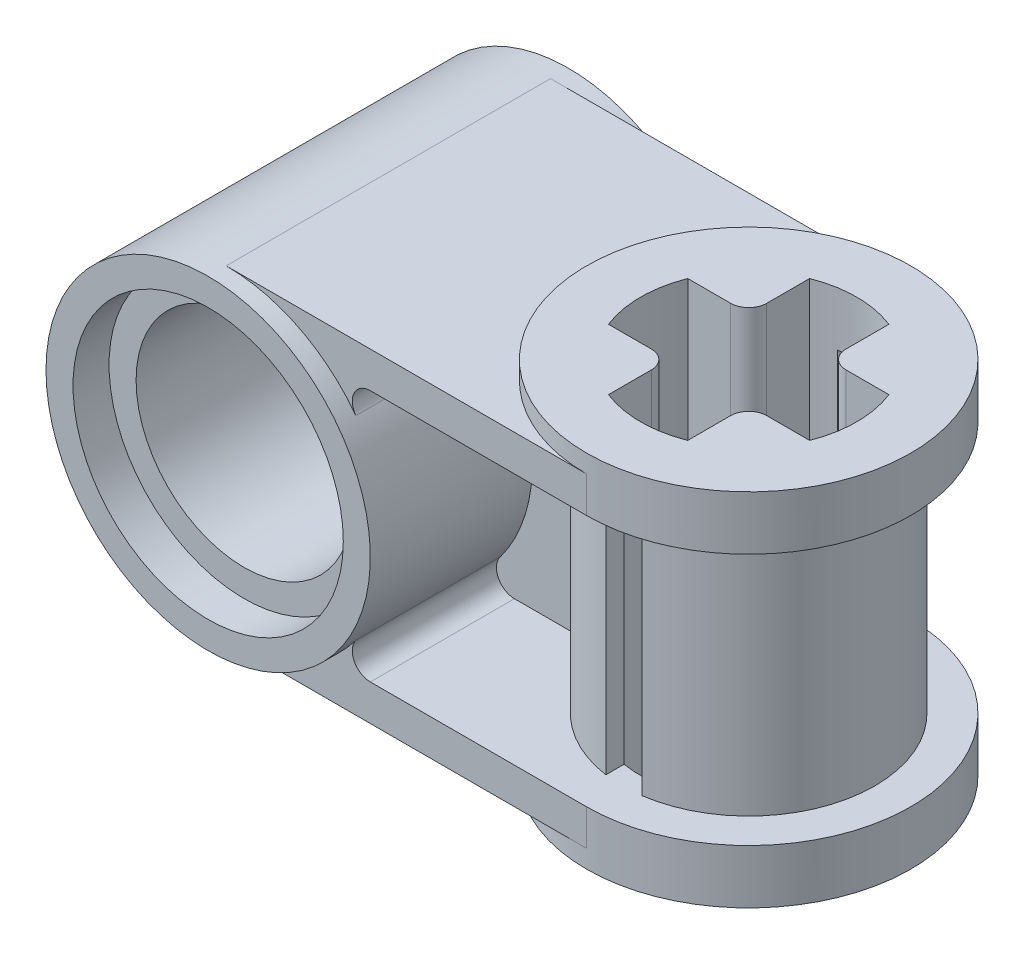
ISO-10303-21;
HEADER;
FILE_DESCRIPTION(('STEP AP214'),'2;1');
FILE_NAME('part.step','',(''),(''),'','','');
FILE_SCHEMA(('AUTOMOTIVE_DESIGN { 1 0 10303 214 1 1 1 1 }'));
ENDSEC;
DATA;
#1=APPLICATION_CONTEXT('core data for automotive mechanical design processes');
#2=APPLICATION_PROTOCOL_DEFINITION('international standard','automotive_design',2000,#1);
#3=PRODUCT_CONTEXT('',#1,'mechanical');
#4=PRODUCT('Part','Part','',(#3));
#5=PRODUCT_RELATED_PRODUCT_CATEGORY('part','',(#4));
#6=PRODUCT_DEFINITION_FORMATION('','',#4);
#7=PRODUCT_DEFINITION_CONTEXT('part definition',#1,'design');
#8=PRODUCT_DEFINITION('design','',#6,#7);
#9=PRODUCT_DEFINITION_SHAPE('','',#8);
#10=(LENGTH_UNIT() NAMED_UNIT(*) SI_UNIT(.MILLI.,.METRE.));
#11=(NAMED_UNIT(*) PLANE_ANGLE_UNIT() SI_UNIT($,.RADIAN.));
#12=(NAMED_UNIT(*) SI_UNIT($,.STERADIAN.) SOLID_ANGLE_UNIT());
#13=UNCERTAINTY_MEASURE_WITH_UNIT(LENGTH_MEASURE(1.E-05),#10,'distance_accuracy_value','');
#14=(GEOMETRIC_REPRESENTATION_CONTEXT(3) GLOBAL_UNCERTAINTY_ASSIGNED_CONTEXT((#13)) GLOBAL_UNIT_ASSIGNED_CONTEXT((#10,
#11,#12)) REPRESENTATION_CONTEXT('',''));
#15=CARTESIAN_POINT('',(0.,0.,0.));
#16=DIRECTION('',(0.,0.,1.));
#17=DIRECTION('',(1.,0.,0.));
#18=AXIS2_PLACEMENT_3D('',#15,#16,#17);
#19=CARTESIAN_POINT('',(0.,2.8,0.));
#20=DIRECTION('',(0.,-1.,0.));
#21=DIRECTION('',(0.,0.,-1.));
#22=AXIS2_PLACEMENT_3D('',#19,#20,#21);
#23=CYLINDRICAL_SURFACE('',#22,2.8);
#24=DIRECTION('',(0.,-1.,0.));
#25=VECTOR('',#24,1.);
#26=CARTESIAN_POINT('',(0.4,2.8,2.7712812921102));
#27=LINE('',#26,#25);
#28=CARTESIAN_POINT('',(0.4,-2.8,2.7712812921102));
#29=VERTEX_POINT('',#28);
#30=CARTESIAN_POINT('',(0.4,2.8,2.7712812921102));
#31=VERTEX_POINT('',#30);
#32=EDGE_CURVE('E11',#29,#31,#27,.F.);
#33=ORIENTED_EDGE('',*,*,#32,.F.);
#34=CARTESIAN_POINT('',(0.,-2.8,0.));
#35=DIRECTION('',(0.,-1.,0.));
#36=DIRECTION('',(0.,0.,1.));
#37=AXIS2_PLACEMENT_3D('',#34,#35,#36);
#38=CIRCLE('',#37,2.8);
#39=CARTESIAN_POINT('',(0.4,-2.8,-2.7712812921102));
#40=VERTEX_POINT('',#39);
#41=EDGE_CURVE('E310',#40,#29,#38,.T.);
#42=ORIENTED_EDGE('',*,*,#41,.F.);
#43=DIRECTION('',(0.,-1.,0.));
#44=VECTOR('',#43,1.);
#45=CARTESIAN_POINT('',(0.4,2.8,-2.7712812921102));
#46=LINE('',#45,#44);
#47=CARTESIAN_POINT('',(0.399999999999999,2.8,-2.7712812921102));
#48=VERTEX_POINT('',#47);
#49=EDGE_CURVE('E48',#48,#40,#46,.T.);
#50=ORIENTED_EDGE('',*,*,#49,.F.);
#51=CARTESIAN_POINT('',(0.,2.8,0.));
#52=DIRECTION('',(0.,-1.,0.));
#53=DIRECTION('',(0.,0.,1.));
#54=AXIS2_PLACEMENT_3D('',#51,#52,#53);
#55=CIRCLE('',#54,2.8);
#56=EDGE_CURVE('E308',#48,#31,#55,.T.);
#57=ORIENTED_EDGE('',*,*,#56,.T.);
#58=EDGE_LOOP('',(#33,#42,#50,#57));
#59=FACE_BOUND('',#58,.T.);
#60=ADVANCED_FACE('F39',(#59),#23,.T.);
#61=DIRECTION('',(0.,-1.,0.));
#62=VECTOR('',#61,1.);
#63=CARTESIAN_POINT('',(-0.4,2.8,-2.7712812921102));
#64=LINE('',#63,#62);
#65=CARTESIAN_POINT('',(-0.4,-2.8,-2.7712812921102));
#66=VERTEX_POINT('',#65);
#67=CARTESIAN_POINT('',(-0.4,2.8,-2.7712812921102));
#68=VERTEX_POINT('',#67);
#69=EDGE_CURVE('E312',#66,#68,#64,.F.);
#70=ORIENTED_EDGE('',*,*,#69,.F.);
#71=CARTESIAN_POINT('',(-2.7712812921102,-2.8,-0.4));
#72=VERTEX_POINT('',#71);
#73=EDGE_CURVE('E323',#72,#66,#38,.T.);
#74=ORIENTED_EDGE('',*,*,#73,.F.);
#75=DIRECTION('',(0.,-1.,0.));
#76=VECTOR('',#75,1.);
#77=CARTESIAN_POINT('',(-2.7712812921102,2.8,-0.4));
#78=LINE('',#77,#76);
#79=CARTESIAN_POINT('',(-2.7712812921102,2.8,-0.4));
#80=VERTEX_POINT('',#79);
#81=EDGE_CURVE('E322',#80,#72,#78,.T.);
#82=ORIENTED_EDGE('',*,*,#81,.F.);
#83=EDGE_CURVE('E316',#80,#68,#55,.T.);
#84=ORIENTED_EDGE('',*,*,#83,.T.);
#85=EDGE_LOOP('',(#70,#74,#82,#84));
#86=FACE_BOUND('',#85,.T.);
#87=ADVANCED_FACE('F717',(#86),#23,.T.);
#88=CARTESIAN_POINT('',(0.,-3.6,-3.6));
#89=DIRECTION('',(0.,0.,-1.));
#90=DIRECTION('',(-1.,0.,0.));
#91=AXIS2_PLACEMENT_3D('',#88,#89,#90);
#92=PLANE('',#91);
#93=DIRECTION('',(1.,0.,0.));
#94=VECTOR('',#93,1.);
#95=CARTESIAN_POINT('',(-4.8,-2.8,-3.6));
#96=LINE('',#95,#94);
#97=CARTESIAN_POINT('',(-4.8,-2.8,-3.6));
#98=VERTEX_POINT('',#97);
#99=CARTESIAN_POINT('',(0.,-2.8,-3.6));
#100=VERTEX_POINT('',#99);
#101=EDGE_CURVE('E346',#98,#100,#96,.T.);
#102=ORIENTED_EDGE('',*,*,#101,.T.);
#103=DIRECTION('',(0.,1.,0.));
#104=VECTOR('',#103,1.);
#105=CARTESIAN_POINT('',(0.,-3.6,-3.6));
#106=LINE('',#105,#104);
#107=CARTESIAN_POINT('',(0.,-3.6,-3.6));
#108=VERTEX_POINT('',#107);
#109=EDGE_CURVE('E683',#108,#100,#106,.T.);
#110=ORIENTED_EDGE('',*,*,#109,.F.);
#111=DIRECTION('',(-1.,0.,0.));
#112=VECTOR('',#111,1.);
#113=CARTESIAN_POINT('',(0.,-3.6,-3.6));
#114=LINE('',#113,#112);
#115=CARTESIAN_POINT('',(-8.,-3.6,-3.6));
#116=VERTEX_POINT('',#115);
#117=EDGE_CURVE('E664',#108,#116,#114,.T.);
#118=ORIENTED_EDGE('',*,*,#117,.T.);
#119=CARTESIAN_POINT('',(-8.,0.,-3.6));
#120=DIRECTION('',(0.,0.,-1.));
#121=DIRECTION('',(-1.,0.,0.));
#122=AXIS2_PLACEMENT_3D('',#119,#120,#121);
#123=CIRCLE('',#122,3.6);
#124=CARTESIAN_POINT('',(-5.12,-2.16,-3.6));
#125=VERTEX_POINT('',#124);
#126=EDGE_CURVE('E643',#116,#125,#123,.F.);
#127=ORIENTED_EDGE('',*,*,#126,.T.);
#128=CARTESIAN_POINT('',(-4.8,-2.4,-3.6));
#129=DIRECTION('',(0.,0.,1.));
#130=DIRECTION('',(1.,0.,0.));
#131=AXIS2_PLACEMENT_3D('',#128,#129,#130);
#132=CIRCLE('',#131,0.4);
#133=EDGE_CURVE('E340',#125,#98,#132,.T.);
#134=ORIENTED_EDGE('',*,*,#133,.T.);
#135=EDGE_LOOP('',(#102,#110,#118,#127,#134));
#136=FACE_BOUND('',#135,.T.);
#137=ADVANCED_FACE('F803',(#136),#92,.T.);
#138=CARTESIAN_POINT('',(0.,-3.6,0.));
#139=DIRECTION('',(0.,1.,0.));
#140=DIRECTION('',(0.,0.,1.));
#141=AXIS2_PLACEMENT_3D('',#138,#139,#140);
#142=CYLINDRICAL_SURFACE('',#141,3.6);
#143=CARTESIAN_POINT('',(0.,-4.,0.));
#144=DIRECTION('',(0.,1.,0.));
#145=DIRECTION('',(0.,0.,1.));
#146=AXIS2_PLACEMENT_3D('',#143,#144,#145);
#147=CIRCLE('',#146,3.6);
#148=CARTESIAN_POINT('',(0.,-4.,3.6));
#149=VERTEX_POINT('',#148);
#150=EDGE_CURVE('E563',#149,#149,#147,.T.);
#151=ORIENTED_EDGE('',*,*,#150,.T.);
#152=EDGE_LOOP('',(#151));
#153=FACE_BOUND('',#152,.T.);
#154=ORIENTED_EDGE('',*,*,#109,.T.);
#155=CARTESIAN_POINT('',(0.,-2.8,0.));
#156=DIRECTION('',(0.,1.,0.));
#157=DIRECTION('',(0.,0.,1.));
#158=AXIS2_PLACEMENT_3D('',#155,#156,#157);
#159=CIRCLE('',#158,3.6);
#160=CARTESIAN_POINT('',(0.,-2.8,3.6));
#161=VERTEX_POINT('',#160);
#162=EDGE_CURVE('E334',#100,#161,#159,.F.);
#163=ORIENTED_EDGE('',*,*,#162,.T.);
#164=DIRECTION('',(0.,1.,0.));
#165=VECTOR('',#164,1.);
#166=CARTESIAN_POINT('',(0.,-3.6,3.6));
#167=LINE('',#166,#165);
#168=CARTESIAN_POINT('',(0.,-3.6,3.6));
#169=VERTEX_POINT('',#168);
#170=EDGE_CURVE('E677',#169,#161,#167,.T.);
#171=ORIENTED_EDGE('',*,*,#170,.F.);
#172=CARTESIAN_POINT('',(0.,-3.6,0.));
#173=DIRECTION('',(0.,1.,0.));
#174=DIRECTION('',(0.,0.,1.));
#175=AXIS2_PLACEMENT_3D('',#172,#173,#174);
#176=CIRCLE('',#175,3.6);
#177=EDGE_CURVE('E696',#108,#169,#176,.T.);
#178=ORIENTED_EDGE('',*,*,#177,.F.);
#179=EDGE_LOOP('',(#154,#163,#171,#178));
#180=FACE_BOUND('',#179,.T.);
#181=ADVANCED_FACE('F810',(#153,#180),#142,.T.);
#182=CARTESIAN_POINT('',(0.,-3.6,3.6));
#183=DIRECTION('',(0.,0.,1.));
#184=DIRECTION('',(1.,0.,0.));
#185=AXIS2_PLACEMENT_3D('',#182,#183,#184);
#186=PLANE('',#185);
#187=ORIENTED_EDGE('',*,*,#170,.T.);
#188=DIRECTION('',(1.,0.,0.));
#189=VECTOR('',#188,1.);
#190=CARTESIAN_POINT('',(-4.8,-2.8,3.6));
#191=LINE('',#190,#189);
#192=CARTESIAN_POINT('',(-4.8,-2.8,3.6));
#193=VERTEX_POINT('',#192);
#194=EDGE_CURVE('E410',#193,#161,#191,.T.);
#195=ORIENTED_EDGE('',*,*,#194,.F.);
#196=CARTESIAN_POINT('',(-4.8,-2.4,3.6));
#197=DIRECTION('',(0.,0.,1.));
#198=DIRECTION('',(1.,0.,0.));
#199=AXIS2_PLACEMENT_3D('',#196,#197,#198);
#200=CIRCLE('',#199,0.4);
#201=CARTESIAN_POINT('',(-5.12,-2.16,3.6));
#202=VERTEX_POINT('',#201);
#203=EDGE_CURVE('E375',#202,#193,#200,.T.);
#204=ORIENTED_EDGE('',*,*,#203,.F.);
#205=CARTESIAN_POINT('',(-8.,0.,3.6));
#206=DIRECTION('',(0.,0.,1.));
#207=DIRECTION('',(1.,0.,0.));
#208=AXIS2_PLACEMENT_3D('',#205,#206,#207);
#209=CIRCLE('',#208,3.6);
#210=CARTESIAN_POINT('',(-8.,-3.6,3.6));
#211=VERTEX_POINT('',#210);
#212=EDGE_CURVE('E647',#202,#211,#209,.F.);
#213=ORIENTED_EDGE('',*,*,#212,.T.);
#214=DIRECTION('',(1.,0.,0.));
#215=VECTOR('',#214,1.);
#216=CARTESIAN_POINT('',(0.,-3.6,3.6));
#217=LINE('',#216,#215);
#218=EDGE_CURVE('E672',#211,#169,#217,.T.);
#219=ORIENTED_EDGE('',*,*,#218,.T.);
#220=EDGE_LOOP('',(#187,#195,#204,#213,#219));
#221=FACE_BOUND('',#220,.T.);
#222=ADVANCED_FACE('F802',(#221),#186,.T.);
#223=CARTESIAN_POINT('',(0.,2.8,-3.6));
#224=VERTEX_POINT('',#223);
#225=CARTESIAN_POINT('',(0.,3.6,-3.6));
#226=VERTEX_POINT('',#225);
#227=EDGE_CURVE('E676',#224,#226,#106,.T.);
#228=ORIENTED_EDGE('',*,*,#227,.F.);
#229=DIRECTION('',(-1.,0.,0.));
#230=VECTOR('',#229,1.);
#231=CARTESIAN_POINT('',(-4.8,2.8,-3.6));
#232=LINE('',#231,#230);
#233=CARTESIAN_POINT('',(-4.8,2.8,-3.6));
#234=VERTEX_POINT('',#233);
#235=EDGE_CURVE('E366',#224,#234,#232,.T.);
#236=ORIENTED_EDGE('',*,*,#235,.T.);
#237=CARTESIAN_POINT('',(-4.8,2.4,-3.6));
#238=DIRECTION('',(0.,0.,1.));
#239=DIRECTION('',(1.,0.,0.));
#240=AXIS2_PLACEMENT_3D('',#237,#238,#239);
#241=CIRCLE('',#240,0.4);
#242=CARTESIAN_POINT('',(-5.12,2.16,-3.6));
#243=VERTEX_POINT('',#242);
#244=EDGE_CURVE('E362',#234,#243,#241,.T.);
#245=ORIENTED_EDGE('',*,*,#244,.T.);
#246=CARTESIAN_POINT('',(-8.,3.6,-3.6));
#247=VERTEX_POINT('',#246);
#248=EDGE_CURVE('E642',#243,#247,#123,.F.);
#249=ORIENTED_EDGE('',*,*,#248,.T.);
#250=DIRECTION('',(-1.,0.,0.));
#251=VECTOR('',#250,1.);
#252=CARTESIAN_POINT('',(0.,3.6,-3.6));
#253=LINE('',#252,#251);
#254=EDGE_CURVE('E652',#226,#247,#253,.T.);
#255=ORIENTED_EDGE('',*,*,#254,.F.);
#256=EDGE_LOOP('',(#228,#236,#245,#249,#255));
#257=FACE_BOUND('',#256,.T.);
#258=ADVANCED_FACE('F800',(#257),#92,.T.);
#259=CARTESIAN_POINT('',(0.,3.6,0.));
#260=DIRECTION('',(0.,1.,0.));
#261=DIRECTION('',(0.,0.,1.));
#262=AXIS2_PLACEMENT_3D('',#259,#260,#261);
#263=PLANE('',#262);
#264=DIRECTION('',(1.,0.,0.));
#265=VECTOR('',#264,1.);
#266=CARTESIAN_POINT('',(0.,3.6,3.6));
#267=LINE('',#266,#265);
#268=CARTESIAN_POINT('',(-8.,3.6,3.6));
#269=VERTEX_POINT('',#268);
#270=CARTESIAN_POINT('',(0.,3.6,3.6));
#271=VERTEX_POINT('',#270);
#272=EDGE_CURVE('E660',#269,#271,#267,.T.);
#273=ORIENTED_EDGE('',*,*,#272,.T.);
#274=CARTESIAN_POINT('',(0.,3.6,0.));
#275=DIRECTION('',(0.,1.,0.));
#276=DIRECTION('',(0.,0.,1.));
#277=AXIS2_PLACEMENT_3D('',#274,#275,#276);
#278=CIRCLE('',#277,3.6);
#279=EDGE_CURVE('E681',#271,#226,#278,.F.);
#280=ORIENTED_EDGE('',*,*,#279,.T.);
#281=ORIENTED_EDGE('',*,*,#254,.T.);
#282=DIRECTION('',(0.,0.,1.));
#283=VECTOR('',#282,1.);
#284=CARTESIAN_POINT('',(-8.,3.6,3.6));
#285=LINE('',#284,#283);
#286=EDGE_CURVE('E656',#247,#269,#285,.T.);
#287=ORIENTED_EDGE('',*,*,#286,.T.);
#288=EDGE_LOOP('',(#273,#280,#281,#287));
#289=FACE_BOUND('',#288,.T.);
#290=ADVANCED_FACE('F797',(#289),#263,.T.);
#291=CARTESIAN_POINT('',(-8.,0.,-4.));
#292=DIRECTION('',(0.,0.,1.));
#293=DIRECTION('',(1.,0.,0.));
#294=AXIS2_PLACEMENT_3D('',#291,#292,#293);
#295=CYLINDRICAL_SURFACE('',#294,2.4);
#296=CARTESIAN_POINT('',(-8.,0.,3.2));
#297=DIRECTION('',(0.,0.,1.));
#298=DIRECTION('',(1.,0.,0.));
#299=AXIS2_PLACEMENT_3D('',#296,#297,#298);
#300=CIRCLE('',#299,2.4);
#301=CARTESIAN_POINT('',(-5.6,0.,3.2));
#302=VERTEX_POINT('',#301);
#303=EDGE_CURVE('E633',#302,#302,#300,.F.);
#304=CARTESIAN_POINT('',(-8.,0.,-3.2));
#305=DIRECTION('',(0.,0.,-1.));
#306=DIRECTION('',(-1.,0.,0.));
#307=AXIS2_PLACEMENT_3D('',#304,#305,#306);
#308=CIRCLE('',#307,2.4);
#309=CARTESIAN_POINT('',(-5.6,0.,-3.2));
#310=VERTEX_POINT('',#309);
#311=EDGE_CURVE('E624',#310,#310,#308,.F.);
#312=CARTESIAN_POINT('',(-5.6,0.,3.2));
#313=CARTESIAN_POINT('',(-5.6,0.,3.13333333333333));
#314=CARTESIAN_POINT('',(-5.6,0.,3.06666666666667));
#315=CARTESIAN_POINT('',(-5.6,0.,2.93333333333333));
#316=CARTESIAN_POINT('',(-5.6,0.,2.86666666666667));
#317=CARTESIAN_POINT('',(-5.6,0.,2.73333333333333));
#318=CARTESIAN_POINT('',(-5.6,0.,2.66666666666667));
#319=CARTESIAN_POINT('',(-5.6,0.,2.53333333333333));
#320=CARTESIAN_POINT('',(-5.6,0.,2.46666666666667));
#321=CARTESIAN_POINT('',(-5.6,0.,2.33333333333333));
#322=CARTESIAN_POINT('',(-5.6,0.,2.26666666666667));
#323=CARTESIAN_POINT('',(-5.6,0.,2.13333333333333));
#324=CARTESIAN_POINT('',(-5.6,0.,2.06666666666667));
#325=CARTESIAN_POINT('',(-5.6,0.,1.93333333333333));
#326=CARTESIAN_POINT('',(-5.6,0.,1.86666666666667));
#327=CARTESIAN_POINT('',(-5.6,0.,1.73333333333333));
#328=CARTESIAN_POINT('',(-5.6,0.,1.66666666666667));
#329=CARTESIAN_POINT('',(-5.6,0.,1.53333333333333));
#330=CARTESIAN_POINT('',(-5.6,0.,1.46666666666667));
#331=CARTESIAN_POINT('',(-5.6,0.,1.33333333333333));
#332=CARTESIAN_POINT('',(-5.6,0.,1.26666666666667));
#333=CARTESIAN_POINT('',(-5.6,0.,1.13333333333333));
#334=CARTESIAN_POINT('',(-5.6,0.,1.06666666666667));
#335=CARTESIAN_POINT('',(-5.6,0.,0.933333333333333));
#336=CARTESIAN_POINT('',(-5.6,0.,0.866666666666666));
#337=CARTESIAN_POINT('',(-5.6,0.,0.733333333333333));
#338=CARTESIAN_POINT('',(-5.6,0.,0.666666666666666));
#339=CARTESIAN_POINT('',(-5.6,0.,0.533333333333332));
#340=CARTESIAN_POINT('',(-5.6,0.,0.466666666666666));
#341=CARTESIAN_POINT('',(-5.6,0.,0.333333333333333));
#342=CARTESIAN_POINT('',(-5.6,0.,0.266666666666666));
#343=CARTESIAN_POINT('',(-5.6,0.,0.133333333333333));
#344=CARTESIAN_POINT('',(-5.6,0.,0.066666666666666));
#345=CARTESIAN_POINT('',(-5.6,0.,-0.0666666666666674));
#346=CARTESIAN_POINT('',(-5.6,0.,-0.133333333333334));
#347=CARTESIAN_POINT('',(-5.6,0.,-0.266666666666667));
#348=CARTESIAN_POINT('',(-5.6,0.,-0.333333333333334));
#349=CARTESIAN_POINT('',(-5.6,0.,-0.466666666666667));
#350=CARTESIAN_POINT('',(-5.6,0.,-0.533333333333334));
#351=CARTESIAN_POINT('',(-5.6,0.,-0.666666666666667));
#352=CARTESIAN_POINT('',(-5.6,0.,-0.733333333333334));
#353=CARTESIAN_POINT('',(-5.6,0.,-0.866666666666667));
#354=CARTESIAN_POINT('',(-5.6,0.,-0.933333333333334));
#355=CARTESIAN_POINT('',(-5.6,0.,-1.06666666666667));
#356=CARTESIAN_POINT('',(-5.6,0.,-1.13333333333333));
#357=CARTESIAN_POINT('',(-5.6,0.,-1.26666666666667));
#358=CARTESIAN_POINT('',(-5.6,0.,-1.33333333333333));
#359=CARTESIAN_POINT('',(-5.6,0.,-1.46666666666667));
#360=CARTESIAN_POINT('',(-5.6,0.,-1.53333333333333));
#361=CARTESIAN_POINT('',(-5.6,0.,-1.66666666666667));
#362=CARTESIAN_POINT('',(-5.6,0.,-1.73333333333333));
#363=CARTESIAN_POINT('',(-5.6,0.,-1.86666666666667));
#364=CARTESIAN_POINT('',(-5.6,0.,-1.93333333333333));
#365=CARTESIAN_POINT('',(-5.6,0.,-2.06666666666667));
#366=CARTESIAN_POINT('',(-5.6,0.,-2.13333333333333));
#367=CARTESIAN_POINT('',(-5.6,0.,-2.26666666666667));
#368=CARTESIAN_POINT('',(-5.6,0.,-2.33333333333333));
#369=CARTESIAN_POINT('',(-5.6,0.,-2.46666666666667));
#370=CARTESIAN_POINT('',(-5.6,0.,-2.53333333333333));
#371=CARTESIAN_POINT('',(-5.6,0.,-2.66666666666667));
#372=CARTESIAN_POINT('',(-5.6,0.,-2.73333333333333));
#373=CARTESIAN_POINT('',(-5.6,0.,-2.86666666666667));
#374=CARTESIAN_POINT('',(-5.6,0.,-2.93333333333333));
#375=CARTESIAN_POINT('',(-5.6,0.,-3.06666666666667));
#376=CARTESIAN_POINT('',(-5.6,0.,-3.13333333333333));
#377=CARTESIAN_POINT('',(-5.6,0.,-3.2));
#378=B_SPLINE_CURVE_WITH_KNOTS('',3,(#312,#313,#314,#315,#316,#317,#318,#319,#320,#321,#322,
#323,#324,#325,#326,#327,#328,#329,#330,#331,#332,#333,#334,#335,#336,#337,#338,#339,#340,#341,
#342,#343,#344,#345,#346,#347,#348,#349,#350,#351,#352,#353,#354,#355,#356,#357,#358,#359,#360,
#361,#362,#363,#364,#365,#366,#367,#368,#369,#370,#371,#372,#373,#374,#375,#376,#377),
.UNSPECIFIED.,.F.,.F.,(4,2,2,2,2,2,2,2,2,2,2,2,2,2,2,2,2,2,2,2,2,2,2,2,2,2,2,2,2,2,2,2,4),(0.,
0.2,0.4,0.6,0.8,1.,1.2,1.4,1.6,1.8,2.,2.2,2.4,2.6,2.8,3.,3.2,3.4,3.6,3.8,4.,4.2,4.4,4.6,4.8,5.,
5.2,5.4,5.6,5.8,6.,6.2,6.4),.UNSPECIFIED.);
#379=EDGE_CURVE('BSEAM808',#302,#310,#378,.T.);
#380=ORIENTED_EDGE('',*,*,#303,.F.);
#381=ORIENTED_EDGE('',*,*,#311,.F.);
#382=ORIENTED_EDGE('',*,*,#379,.T.);
#383=ORIENTED_EDGE('',*,*,#379,.F.);
#384=EDGE_LOOP('',(#380,#382,#381,#383));
#385=FACE_BOUND('',#384,.T.);
#386=ADVANCED_FACE('F808',(#385),#295,.F.);
#387=CARTESIAN_POINT('',(0.,2.8,0.));
#388=DIRECTION('',(0.,1.,0.));
#389=DIRECTION('',(0.,0.,1.));
#390=AXIS2_PLACEMENT_3D('',#387,#388,#389);
#391=CIRCLE('',#390,3.6);
#392=CARTESIAN_POINT('',(0.,2.8,3.6));
#393=VERTEX_POINT('',#392);
#394=EDGE_CURVE('E337',#224,#393,#391,.F.);
#395=ORIENTED_EDGE('',*,*,#394,.F.);
#396=ORIENTED_EDGE('',*,*,#227,.T.);
#397=ORIENTED_EDGE('',*,*,#279,.F.);
#398=EDGE_CURVE('E682',#393,#271,#167,.T.);
#399=ORIENTED_EDGE('',*,*,#398,.F.);
#400=EDGE_LOOP('',(#395,#396,#397,#399));
#401=FACE_BOUND('',#400,.T.);
#402=CARTESIAN_POINT('',(0.,4.,0.));
#403=DIRECTION('',(0.,1.,0.));
#404=DIRECTION('',(0.,0.,1.));
#405=AXIS2_PLACEMENT_3D('',#402,#403,#404);
#406=CIRCLE('',#405,3.6);
#407=CARTESIAN_POINT('',(0.,4.,3.6));
#408=VERTEX_POINT('',#407);
#409=EDGE_CURVE('E612',#408,#408,#406,.T.);
#410=ORIENTED_EDGE('',*,*,#409,.F.);
#411=EDGE_LOOP('',(#410));
#412=FACE_BOUND('',#411,.T.);
#413=ADVANCED_FACE('F41',(#401,#412),#142,.T.);
#414=DIRECTION('',(-1.,0.,0.));
#415=VECTOR('',#414,1.);
#416=CARTESIAN_POINT('',(-4.8,2.8,3.6));
#417=LINE('',#416,#415);
#418=CARTESIAN_POINT('',(-4.8,2.8,3.6));
#419=VERTEX_POINT('',#418);
#420=EDGE_CURVE('E414',#393,#419,#417,.T.);
#421=ORIENTED_EDGE('',*,*,#420,.F.);
#422=ORIENTED_EDGE('',*,*,#398,.T.);
#423=ORIENTED_EDGE('',*,*,#272,.F.);
#424=CARTESIAN_POINT('',(-5.12,2.16,3.6));
#425=VERTEX_POINT('',#424);
#426=EDGE_CURVE('E648',#269,#425,#209,.F.);
#427=ORIENTED_EDGE('',*,*,#426,.T.);
#428=CARTESIAN_POINT('',(-4.8,2.4,3.6));
#429=DIRECTION('',(0.,0.,1.));
#430=DIRECTION('',(1.,0.,0.));
#431=AXIS2_PLACEMENT_3D('',#428,#429,#430);
#432=CIRCLE('',#431,0.4);
#433=EDGE_CURVE('E391',#419,#425,#432,.T.);
#434=ORIENTED_EDGE('',*,*,#433,.F.);
#435=EDGE_LOOP('',(#421,#422,#423,#427,#434));
#436=FACE_BOUND('',#435,.T.);
#437=ADVANCED_FACE('F791',(#436),#186,.T.);
#438=CARTESIAN_POINT('',(0.,-3.6,0.));
#439=DIRECTION('',(0.,1.,0.));
#440=DIRECTION('',(0.,0.,1.));
#441=AXIS2_PLACEMENT_3D('',#438,#439,#440);
#442=PLANE('',#441);
#443=ORIENTED_EDGE('',*,*,#117,.F.);
#444=ORIENTED_EDGE('',*,*,#177,.T.);
#445=ORIENTED_EDGE('',*,*,#218,.F.);
#446=DIRECTION('',(0.,0.,1.));
#447=VECTOR('',#446,1.);
#448=CARTESIAN_POINT('',(-8.,-3.6,3.6));
#449=LINE('',#448,#447);
#450=EDGE_CURVE('E668',#116,#211,#449,.T.);
#451=ORIENTED_EDGE('',*,*,#450,.F.);
#452=EDGE_LOOP('',(#443,#444,#445,#451));
#453=FACE_BOUND('',#452,.T.);
#454=ADVANCED_FACE('F857',(#453),#442,.F.);
#455=CARTESIAN_POINT('',(-8.,0.,4.));
#456=DIRECTION('',(0.,0.,-1.));
#457=DIRECTION('',(-1.,0.,0.));
#458=AXIS2_PLACEMENT_3D('',#455,#456,#457);
#459=CYLINDRICAL_SURFACE('',#458,3.6);
#460=ORIENTED_EDGE('',*,*,#426,.F.);
#461=ORIENTED_EDGE('',*,*,#286,.F.);
#462=ORIENTED_EDGE('',*,*,#248,.F.);
#463=DIRECTION('',(0.,0.,-1.));
#464=VECTOR('',#463,1.);
#465=CARTESIAN_POINT('',(-5.12,2.16,-0.4));
#466=LINE('',#465,#464);
#467=CARTESIAN_POINT('',(-5.12,2.16,-0.4));
#468=VERTEX_POINT('',#467);
#469=EDGE_CURVE('E380',#468,#243,#466,.T.);
#470=ORIENTED_EDGE('',*,*,#469,.F.);
#471=CARTESIAN_POINT('',(-8.,0.,-0.4));
#472=DIRECTION('',(0.,0.,-1.));
#473=DIRECTION('',(1.,0.,0.));
#474=AXIS2_PLACEMENT_3D('',#471,#472,#473);
#475=CIRCLE('',#474,3.6);
#476=CARTESIAN_POINT('',(-5.12,-2.16,-0.4));
#477=VERTEX_POINT('',#476);
#478=EDGE_CURVE('E345',#468,#477,#475,.T.);
#479=ORIENTED_EDGE('',*,*,#478,.T.);
#480=DIRECTION('',(0.,0.,-1.));
#481=VECTOR('',#480,1.);
#482=CARTESIAN_POINT('',(-5.12,-2.16,-0.4));
#483=LINE('',#482,#481);
#484=EDGE_CURVE('E358',#477,#125,#483,.T.);
#485=ORIENTED_EDGE('',*,*,#484,.T.);
#486=ORIENTED_EDGE('',*,*,#126,.F.);
#487=ORIENTED_EDGE('',*,*,#450,.T.);
#488=ORIENTED_EDGE('',*,*,#212,.F.);
#489=DIRECTION('',(0.,0.,1.));
#490=VECTOR('',#489,1.);
#491=CARTESIAN_POINT('',(-5.12,-2.16,0.4));
#492=LINE('',#491,#490);
#493=CARTESIAN_POINT('',(-5.12,-2.16,0.4));
#494=VERTEX_POINT('',#493);
#495=EDGE_CURVE('E419',#494,#202,#492,.T.);
#496=ORIENTED_EDGE('',*,*,#495,.F.);
#497=CARTESIAN_POINT('',(-8.,0.,0.4));
#498=DIRECTION('',(0.,0.,-1.));
#499=DIRECTION('',(1.,0.,0.));
#500=AXIS2_PLACEMENT_3D('',#497,#498,#499);
#501=CIRCLE('',#500,3.6);
#502=CARTESIAN_POINT('',(-5.12,2.16,0.4));
#503=VERTEX_POINT('',#502);
#504=EDGE_CURVE('E402',#503,#494,#501,.T.);
#505=ORIENTED_EDGE('',*,*,#504,.F.);
#506=DIRECTION('',(0.,0.,1.));
#507=VECTOR('',#506,1.);
#508=CARTESIAN_POINT('',(-5.12,2.16,0.4));
#509=LINE('',#508,#507);
#510=EDGE_CURVE('E423',#503,#425,#509,.T.);
#511=ORIENTED_EDGE('',*,*,#510,.T.);
#512=EDGE_LOOP('',(#460,#461,#462,#470,#479,#485,#486,#487,#488,#496,#505,#511));
#513=FACE_BOUND('',#512,.T.);
#514=CARTESIAN_POINT('',(-8.,0.,4.));
#515=DIRECTION('',(0.,0.,1.));
#516=DIRECTION('',(-1.,0.,0.));
#517=AXIS2_PLACEMENT_3D('',#514,#515,#516);
#518=CIRCLE('',#517,3.6);
#519=CARTESIAN_POINT('',(-11.6,0.,4.));
#520=VERTEX_POINT('',#519);
#521=EDGE_CURVE('E638',#520,#520,#518,.T.);
#522=ORIENTED_EDGE('',*,*,#521,.F.);
#523=EDGE_LOOP('',(#522));
#524=FACE_BOUND('',#523,.T.);
#525=CARTESIAN_POINT('',(-8.,0.,-4.));
#526=DIRECTION('',(0.,0.,1.));
#527=DIRECTION('',(-1.,0.,0.));
#528=AXIS2_PLACEMENT_3D('',#525,#526,#527);
#529=CIRCLE('',#528,3.6);
#530=CARTESIAN_POINT('',(-11.6,0.,-4.));
#531=VERTEX_POINT('',#530);
#532=EDGE_CURVE('E634',#531,#531,#529,.T.);
#533=ORIENTED_EDGE('',*,*,#532,.T.);
#534=EDGE_LOOP('',(#533));
#535=FACE_BOUND('',#534,.T.);
#536=ADVANCED_FACE('F777',(#513,#524,#535),#459,.T.);
#537=CARTESIAN_POINT('',(-8.,0.,4.));
#538=DIRECTION('',(0.,0.,-1.));
#539=DIRECTION('',(-1.,0.,0.));
#540=AXIS2_PLACEMENT_3D('',#537,#538,#539);
#541=PLANE('',#540);
#542=CARTESIAN_POINT('',(-8.,0.,4.));
#543=DIRECTION('',(0.,0.,1.));
#544=DIRECTION('',(1.,0.,0.));
#545=AXIS2_PLACEMENT_3D('',#542,#543,#544);
#546=CIRCLE('',#545,3.);
#547=CARTESIAN_POINT('',(-5.,0.,4.));
#548=VERTEX_POINT('',#547);
#549=EDGE_CURVE('E629',#548,#548,#546,.T.);
#550=ORIENTED_EDGE('',*,*,#549,.F.);
#551=EDGE_LOOP('',(#550));
#552=FACE_BOUND('',#551,.T.);
#553=ORIENTED_EDGE('',*,*,#521,.T.);
#554=EDGE_LOOP('',(#553));
#555=FACE_BOUND('',#554,.T.);
#556=ADVANCED_FACE('F864',(#552,#555),#541,.F.);
#557=CARTESIAN_POINT('',(-8.,0.,-4.));
#558=DIRECTION('',(0.,0.,-1.));
#559=DIRECTION('',(-1.,0.,0.));
#560=AXIS2_PLACEMENT_3D('',#557,#558,#559);
#561=PLANE('',#560);
#562=CARTESIAN_POINT('',(-8.,0.,-4.));
#563=DIRECTION('',(0.,0.,1.));
#564=DIRECTION('',(1.,0.,0.));
#565=AXIS2_PLACEMENT_3D('',#562,#563,#564);
#566=CIRCLE('',#565,3.);
#567=CARTESIAN_POINT('',(-5.,0.,-4.));
#568=VERTEX_POINT('',#567);
#569=EDGE_CURVE('E620',#568,#568,#566,.T.);
#570=ORIENTED_EDGE('',*,*,#569,.T.);
#571=EDGE_LOOP('',(#570));
#572=FACE_BOUND('',#571,.T.);
#573=ORIENTED_EDGE('',*,*,#532,.F.);
#574=EDGE_LOOP('',(#573));
#575=FACE_BOUND('',#574,.T.);
#576=ADVANCED_FACE('F869',(#572,#575),#561,.T.);
#577=CARTESIAN_POINT('',(-8.,0.,3.2));
#578=DIRECTION('',(0.,0.,1.));
#579=DIRECTION('',(1.,0.,0.));
#580=AXIS2_PLACEMENT_3D('',#577,#578,#579);
#581=PLANE('',#580);
#582=CARTESIAN_POINT('',(-8.,0.,3.2));
#583=DIRECTION('',(0.,0.,1.));
#584=DIRECTION('',(1.,0.,0.));
#585=AXIS2_PLACEMENT_3D('',#582,#583,#584);
#586=CIRCLE('',#585,3.);
#587=CARTESIAN_POINT('',(-5.,0.,3.2));
#588=VERTEX_POINT('',#587);
#589=EDGE_CURVE('E625',#588,#588,#586,.T.);
#590=ORIENTED_EDGE('',*,*,#589,.T.);
#591=EDGE_LOOP('',(#590));
#592=FACE_BOUND('',#591,.T.);
#593=ORIENTED_EDGE('',*,*,#303,.T.);
#594=EDGE_LOOP('',(#593));
#595=FACE_BOUND('',#594,.T.);
#596=ADVANCED_FACE('F873',(#592,#595),#581,.T.);
#597=CARTESIAN_POINT('',(-8.,0.,4.));
#598=DIRECTION('',(0.,0.,-1.));
#599=DIRECTION('',(-1.,0.,0.));
#600=AXIS2_PLACEMENT_3D('',#597,#598,#599);
#601=CYLINDRICAL_SURFACE('',#600,3.);
#602=ORIENTED_EDGE('',*,*,#549,.T.);
#603=EDGE_LOOP('',(#602));
#604=FACE_BOUND('',#603,.T.);
#605=ORIENTED_EDGE('',*,*,#589,.F.);
#606=EDGE_LOOP('',(#605));
#607=FACE_BOUND('',#606,.T.);
#608=ADVANCED_FACE('F878',(#604,#607),#601,.F.);
#609=CARTESIAN_POINT('',(-8.,0.,-3.2));
#610=DIRECTION('',(0.,0.,-1.));
#611=DIRECTION('',(1.,0.,0.));
#612=AXIS2_PLACEMENT_3D('',#609,#610,#611);
#613=PLANE('',#612);
#614=CARTESIAN_POINT('',(-8.,0.,-3.2));
#615=DIRECTION('',(0.,0.,1.));
#616=DIRECTION('',(1.,0.,0.));
#617=AXIS2_PLACEMENT_3D('',#614,#615,#616);
#618=CIRCLE('',#617,3.);
#619=CARTESIAN_POINT('',(-5.,0.,-3.2));
#620=VERTEX_POINT('',#619);
#621=EDGE_CURVE('E616',#620,#620,#618,.T.);
#622=ORIENTED_EDGE('',*,*,#621,.F.);
#623=EDGE_LOOP('',(#622));
#624=FACE_BOUND('',#623,.T.);
#625=ORIENTED_EDGE('',*,*,#311,.T.);
#626=EDGE_LOOP('',(#625));
#627=FACE_BOUND('',#626,.T.);
#628=ADVANCED_FACE('F881',(#624,#627),#613,.T.);
#629=CARTESIAN_POINT('',(-8.,0.,-4.));
#630=DIRECTION('',(0.,0.,1.));
#631=DIRECTION('',(1.,0.,0.));
#632=AXIS2_PLACEMENT_3D('',#629,#630,#631);
#633=CYLINDRICAL_SURFACE('',#632,3.);
#634=ORIENTED_EDGE('',*,*,#569,.F.);
#635=EDGE_LOOP('',(#634));
#636=FACE_BOUND('',#635,.T.);
#637=ORIENTED_EDGE('',*,*,#621,.T.);
#638=EDGE_LOOP('',(#637));
#639=FACE_BOUND('',#638,.T.);
#640=ADVANCED_FACE('F886',(#636,#639),#633,.F.);
#641=CARTESIAN_POINT('',(0.,4.,0.));
#642=DIRECTION('',(0.,1.,0.));
#643=DIRECTION('',(0.,0.,1.));
#644=AXIS2_PLACEMENT_3D('',#641,#642,#643);
#645=PLANE('',#644);
#646=CARTESIAN_POINT('',(0.,4.,0.));
#647=DIRECTION('',(0.,1.,0.));
#648=DIRECTION('',(0.,0.,1.));
#649=AXIS2_PLACEMENT_3D('',#646,#647,#648);
#650=CIRCLE('',#649,2.4);
#651=CARTESIAN_POINT('',(0.88,4.,-2.23284571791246));
#652=VERTEX_POINT('',#651);
#653=CARTESIAN_POINT('',(-0.88,4.,-2.23284571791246));
#654=VERTEX_POINT('',#653);
#655=EDGE_CURVE('E422',#652,#654,#650,.T.);
#656=ORIENTED_EDGE('',*,*,#655,.F.);
#657=DIRECTION('',(0.,0.,-1.));
#658=VECTOR('',#657,1.);
#659=CARTESIAN_POINT('',(0.880000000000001,4.,-1.28));
#660=LINE('',#659,#658);
#661=CARTESIAN_POINT('',(0.880000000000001,4.,-1.28));
#662=VERTEX_POINT('',#661);
#663=EDGE_CURVE('E438',#662,#652,#660,.T.);
#664=ORIENTED_EDGE('',*,*,#663,.F.);
#665=CARTESIAN_POINT('',(1.28,4.,-1.28));
#666=DIRECTION('',(0.,-1.,0.));
#667=DIRECTION('',(0.,0.,-1.));
#668=AXIS2_PLACEMENT_3D('',#665,#666,#667);
#669=CIRCLE('',#668,0.4);
#670=CARTESIAN_POINT('',(1.28,4.,-0.88));
#671=VERTEX_POINT('',#670);
#672=EDGE_CURVE('E553',#671,#662,#669,.T.);
#673=ORIENTED_EDGE('',*,*,#672,.F.);
#674=DIRECTION('',(-1.,0.,0.));
#675=VECTOR('',#674,1.);
#676=CARTESIAN_POINT('',(2.23284571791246,4.,-0.88));
#677=LINE('',#676,#675);
#678=CARTESIAN_POINT('',(2.23284571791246,4.,-0.88));
#679=VERTEX_POINT('',#678);
#680=EDGE_CURVE('E549',#679,#671,#677,.T.);
#681=ORIENTED_EDGE('',*,*,#680,.F.);
#682=CARTESIAN_POINT('',(0.,4.,0.));
#683=DIRECTION('',(0.,1.,0.));
#684=DIRECTION('',(0.,0.,1.));
#685=AXIS2_PLACEMENT_3D('',#682,#683,#684);
#686=CIRCLE('',#685,2.4);
#687=CARTESIAN_POINT('',(2.23284571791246,4.,0.880000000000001));
#688=VERTEX_POINT('',#687);
#689=EDGE_CURVE('E545',#688,#679,#686,.T.);
#690=ORIENTED_EDGE('',*,*,#689,.F.);
#691=DIRECTION('',(1.,0.,0.));
#692=VECTOR('',#691,1.);
#693=CARTESIAN_POINT('',(1.28,4.,0.88));
#694=LINE('',#693,#692);
#695=CARTESIAN_POINT('',(1.28,4.,0.88));
#696=VERTEX_POINT('',#695);
#697=EDGE_CURVE('E541',#696,#688,#694,.T.);
#698=ORIENTED_EDGE('',*,*,#697,.F.);
#699=CARTESIAN_POINT('',(1.28,4.,1.28));
#700=DIRECTION('',(0.,-1.,0.));
#701=DIRECTION('',(0.,0.,-1.));
#702=AXIS2_PLACEMENT_3D('',#699,#700,#701);
#703=CIRCLE('',#702,0.4);
#704=CARTESIAN_POINT('',(0.880000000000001,4.,1.28));
#705=VERTEX_POINT('',#704);
#706=EDGE_CURVE('E537',#705,#696,#703,.T.);
#707=ORIENTED_EDGE('',*,*,#706,.F.);
#708=DIRECTION('',(0.,0.,-1.));
#709=VECTOR('',#708,1.);
#710=CARTESIAN_POINT('',(0.88,4.,2.23284571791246));
#711=LINE('',#710,#709);
#712=CARTESIAN_POINT('',(0.88,4.,2.23284571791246));
#713=VERTEX_POINT('',#712);
#714=EDGE_CURVE('E533',#713,#705,#711,.T.);
#715=ORIENTED_EDGE('',*,*,#714,.F.);
#716=CARTESIAN_POINT('',(0.,4.,0.));
#717=DIRECTION('',(0.,1.,0.));
#718=DIRECTION('',(0.,0.,1.));
#719=AXIS2_PLACEMENT_3D('',#716,#717,#718);
#720=CIRCLE('',#719,2.4);
#721=CARTESIAN_POINT('',(-0.880000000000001,4.,2.23284571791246));
#722=VERTEX_POINT('',#721);
#723=EDGE_CURVE('E529',#722,#713,#720,.T.);
#724=ORIENTED_EDGE('',*,*,#723,.F.);
#725=DIRECTION('',(0.,0.,1.));
#726=VECTOR('',#725,1.);
#727=CARTESIAN_POINT('',(-0.88,4.,1.28));
#728=LINE('',#727,#726);
#729=CARTESIAN_POINT('',(-0.88,4.,1.28));
#730=VERTEX_POINT('',#729);
#731=EDGE_CURVE('E525',#730,#722,#728,.T.);
#732=ORIENTED_EDGE('',*,*,#731,.F.);
#733=CARTESIAN_POINT('',(-1.28,4.,1.28));
#734=DIRECTION('',(0.,-1.,0.));
#735=DIRECTION('',(0.,0.,1.));
#736=AXIS2_PLACEMENT_3D('',#733,#734,#735);
#737=CIRCLE('',#736,0.4);
#738=CARTESIAN_POINT('',(-1.28,4.,0.88));
#739=VERTEX_POINT('',#738);
#740=EDGE_CURVE('E521',#739,#730,#737,.T.);
#741=ORIENTED_EDGE('',*,*,#740,.F.);
#742=DIRECTION('',(1.,0.,0.));
#743=VECTOR('',#742,1.);
#744=CARTESIAN_POINT('',(-2.23284571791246,4.,0.88));
#745=LINE('',#744,#743);
#746=CARTESIAN_POINT('',(-2.23284571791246,4.,0.88));
#747=VERTEX_POINT('',#746);
#748=EDGE_CURVE('E517',#747,#739,#745,.T.);
#749=ORIENTED_EDGE('',*,*,#748,.F.);
#750=CARTESIAN_POINT('',(0.,4.,0.));
#751=DIRECTION('',(0.,1.,0.));
#752=DIRECTION('',(0.,0.,1.));
#753=AXIS2_PLACEMENT_3D('',#750,#751,#752);
#754=CIRCLE('',#753,2.4);
#755=CARTESIAN_POINT('',(-2.23284571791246,4.,-0.88));
#756=VERTEX_POINT('',#755);
#757=EDGE_CURVE('E513',#756,#747,#754,.T.);
#758=ORIENTED_EDGE('',*,*,#757,.F.);
#759=DIRECTION('',(-1.,0.,0.));
#760=VECTOR('',#759,1.);
#761=CARTESIAN_POINT('',(-1.28,4.,-0.88));
#762=LINE('',#761,#760);
#763=CARTESIAN_POINT('',(-1.28,4.,-0.88));
#764=VERTEX_POINT('',#763);
#765=EDGE_CURVE('E509',#764,#756,#762,.T.);
#766=ORIENTED_EDGE('',*,*,#765,.F.);
#767=CARTESIAN_POINT('',(-1.28,4.,-1.28));
#768=DIRECTION('',(0.,-1.,0.));
#769=DIRECTION('',(0.,0.,1.));
#770=AXIS2_PLACEMENT_3D('',#767,#768,#769);
#771=CIRCLE('',#770,0.4);
#772=CARTESIAN_POINT('',(-0.88,4.,-1.28));
#773=VERTEX_POINT('',#772);
#774=EDGE_CURVE('E505',#773,#764,#771,.T.);
#775=ORIENTED_EDGE('',*,*,#774,.F.);
#776=DIRECTION('',(0.,0.,1.));
#777=VECTOR('',#776,1.);
#778=CARTESIAN_POINT('',(-0.88,4.,-2.23284571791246));
#779=LINE('',#778,#777);
#780=EDGE_CURVE('E501',#654,#773,#779,.T.);
#781=ORIENTED_EDGE('',*,*,#780,.F.);
#782=EDGE_LOOP('',(#656,#664,#673,#681,#690,#698,#707,#715,#724,#732,#741,#749,#758,#766,#775,#781));
#783=FACE_BOUND('',#782,.T.);
#784=ORIENTED_EDGE('',*,*,#409,.T.);
#785=EDGE_LOOP('',(#784));
#786=FACE_BOUND('',#785,.T.);
#787=ADVANCED_FACE('F889',(#783,#786),#645,.T.);
#788=CARTESIAN_POINT('',(0.,-4.,0.));
#789=DIRECTION('',(0.,-1.,0.));
#790=DIRECTION('',(0.,0.,1.));
#791=AXIS2_PLACEMENT_3D('',#788,#789,#790);
#792=PLANE('',#791);
#793=CARTESIAN_POINT('',(0.,-4.,0.));
#794=DIRECTION('',(0.,1.,0.));
#795=DIRECTION('',(0.,0.,1.));
#796=AXIS2_PLACEMENT_3D('',#793,#794,#795);
#797=CIRCLE('',#796,2.4);
#798=CARTESIAN_POINT('',(0.88,-4.,-2.23284571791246));
#799=VERTEX_POINT('',#798);
#800=CARTESIAN_POINT('',(-0.88,-4.,-2.23284571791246));
#801=VERTEX_POINT('',#800);
#802=EDGE_CURVE('E433',#799,#801,#797,.T.);
#803=ORIENTED_EDGE('',*,*,#802,.T.);
#804=DIRECTION('',(0.,0.,1.));
#805=VECTOR('',#804,1.);
#806=CARTESIAN_POINT('',(-0.88,-4.,-2.23284571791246));
#807=LINE('',#806,#805);
#808=CARTESIAN_POINT('',(-0.88,-4.,-1.28));
#809=VERTEX_POINT('',#808);
#810=EDGE_CURVE('E437',#801,#809,#807,.T.);
#811=ORIENTED_EDGE('',*,*,#810,.T.);
#812=CARTESIAN_POINT('',(-1.28,-4.,-1.28));
#813=DIRECTION('',(0.,-1.,0.));
#814=DIRECTION('',(0.,0.,1.));
#815=AXIS2_PLACEMENT_3D('',#812,#813,#814);
#816=CIRCLE('',#815,0.4);
#817=CARTESIAN_POINT('',(-1.28,-4.,-0.88));
#818=VERTEX_POINT('',#817);
#819=EDGE_CURVE('E442',#809,#818,#816,.T.);
#820=ORIENTED_EDGE('',*,*,#819,.T.);
#821=DIRECTION('',(-1.,0.,0.));
#822=VECTOR('',#821,1.);
#823=CARTESIAN_POINT('',(-1.28,-4.,-0.88));
#824=LINE('',#823,#822);
#825=CARTESIAN_POINT('',(-2.23284571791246,-4.,-0.88));
#826=VERTEX_POINT('',#825);
#827=EDGE_CURVE('E446',#818,#826,#824,.T.);
#828=ORIENTED_EDGE('',*,*,#827,.T.);
#829=CARTESIAN_POINT('',(0.,-4.,0.));
#830=DIRECTION('',(0.,1.,0.));
#831=DIRECTION('',(0.,0.,1.));
#832=AXIS2_PLACEMENT_3D('',#829,#830,#831);
#833=CIRCLE('',#832,2.4);
#834=CARTESIAN_POINT('',(-2.23284571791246,-4.,0.88));
#835=VERTEX_POINT('',#834);
#836=EDGE_CURVE('E450',#826,#835,#833,.T.);
#837=ORIENTED_EDGE('',*,*,#836,.T.);
#838=DIRECTION('',(1.,0.,0.));
#839=VECTOR('',#838,1.);
#840=CARTESIAN_POINT('',(-2.23284571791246,-4.,0.88));
#841=LINE('',#840,#839);
#842=CARTESIAN_POINT('',(-1.28,-4.,0.88));
#843=VERTEX_POINT('',#842);
#844=EDGE_CURVE('E454',#835,#843,#841,.T.);
#845=ORIENTED_EDGE('',*,*,#844,.T.);
#846=CARTESIAN_POINT('',(-1.28,-4.,1.28));
#847=DIRECTION('',(0.,-1.,0.));
#848=DIRECTION('',(0.,0.,1.));
#849=AXIS2_PLACEMENT_3D('',#846,#847,#848);
#850=CIRCLE('',#849,0.4);
#851=CARTESIAN_POINT('',(-0.88,-4.,1.28));
#852=VERTEX_POINT('',#851);
#853=EDGE_CURVE('E458',#843,#852,#850,.T.);
#854=ORIENTED_EDGE('',*,*,#853,.T.);
#855=DIRECTION('',(0.,0.,1.));
#856=VECTOR('',#855,1.);
#857=CARTESIAN_POINT('',(-0.88,-4.,1.28));
#858=LINE('',#857,#856);
#859=CARTESIAN_POINT('',(-0.880000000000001,-4.,2.23284571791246));
#860=VERTEX_POINT('',#859);
#861=EDGE_CURVE('E462',#852,#860,#858,.T.);
#862=ORIENTED_EDGE('',*,*,#861,.T.);
#863=CARTESIAN_POINT('',(0.,-4.,0.));
#864=DIRECTION('',(0.,1.,0.));
#865=DIRECTION('',(0.,0.,1.));
#866=AXIS2_PLACEMENT_3D('',#863,#864,#865);
#867=CIRCLE('',#866,2.4);
#868=CARTESIAN_POINT('',(0.88,-4.,2.23284571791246));
#869=VERTEX_POINT('',#868);
#870=EDGE_CURVE('E466',#860,#869,#867,.T.);
#871=ORIENTED_EDGE('',*,*,#870,.T.);
#872=DIRECTION('',(0.,0.,-1.));
#873=VECTOR('',#872,1.);
#874=CARTESIAN_POINT('',(0.88,-4.,2.23284571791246));
#875=LINE('',#874,#873);
#876=CARTESIAN_POINT('',(0.880000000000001,-4.,1.28));
#877=VERTEX_POINT('',#876);
#878=EDGE_CURVE('E470',#869,#877,#875,.T.);
#879=ORIENTED_EDGE('',*,*,#878,.T.);
#880=CARTESIAN_POINT('',(1.28,-4.,1.28));
#881=DIRECTION('',(0.,-1.,0.));
#882=DIRECTION('',(0.,0.,-1.));
#883=AXIS2_PLACEMENT_3D('',#880,#881,#882);
#884=CIRCLE('',#883,0.4);
#885=CARTESIAN_POINT('',(1.28,-4.,0.88));
#886=VERTEX_POINT('',#885);
#887=EDGE_CURVE('E474',#877,#886,#884,.T.);
#888=ORIENTED_EDGE('',*,*,#887,.T.);
#889=DIRECTION('',(1.,0.,0.));
#890=VECTOR('',#889,1.);
#891=CARTESIAN_POINT('',(1.28,-4.,0.88));
#892=LINE('',#891,#890);
#893=CARTESIAN_POINT('',(2.23284571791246,-4.,0.880000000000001));
#894=VERTEX_POINT('',#893);
#895=EDGE_CURVE('E478',#886,#894,#892,.T.);
#896=ORIENTED_EDGE('',*,*,#895,.T.);
#897=CARTESIAN_POINT('',(0.,-4.,0.));
#898=DIRECTION('',(0.,1.,0.));
#899=DIRECTION('',(0.,0.,1.));
#900=AXIS2_PLACEMENT_3D('',#897,#898,#899);
#901=CIRCLE('',#900,2.4);
#902=CARTESIAN_POINT('',(2.23284571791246,-4.,-0.88));
#903=VERTEX_POINT('',#902);
#904=EDGE_CURVE('E482',#894,#903,#901,.T.);
#905=ORIENTED_EDGE('',*,*,#904,.T.);
#906=DIRECTION('',(-1.,0.,0.));
#907=VECTOR('',#906,1.);
#908=CARTESIAN_POINT('',(2.23284571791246,-4.,-0.88));
#909=LINE('',#908,#907);
#910=CARTESIAN_POINT('',(1.28,-4.,-0.88));
#911=VERTEX_POINT('',#910);
#912=EDGE_CURVE('E486',#903,#911,#909,.T.);
#913=ORIENTED_EDGE('',*,*,#912,.T.);
#914=CARTESIAN_POINT('',(1.28,-4.,-1.28));
#915=DIRECTION('',(0.,-1.,0.));
#916=DIRECTION('',(0.,0.,-1.));
#917=AXIS2_PLACEMENT_3D('',#914,#915,#916);
#918=CIRCLE('',#917,0.4);
#919=CARTESIAN_POINT('',(0.880000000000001,-4.,-1.28));
#920=VERTEX_POINT('',#919);
#921=EDGE_CURVE('E490',#911,#920,#918,.T.);
#922=ORIENTED_EDGE('',*,*,#921,.T.);
#923=DIRECTION('',(0.,0.,-1.));
#924=VECTOR('',#923,1.);
#925=CARTESIAN_POINT('',(0.880000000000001,-4.,-1.28));
#926=LINE('',#925,#924);
#927=EDGE_CURVE('E494',#920,#799,#926,.T.);
#928=ORIENTED_EDGE('',*,*,#927,.T.);
#929=EDGE_LOOP('',(#803,#811,#820,#828,#837,#845,#854,#862,#871,#879,#888,#896,#905,#913,#922,#928));
#930=FACE_BOUND('',#929,.T.);
#931=ORIENTED_EDGE('',*,*,#150,.F.);
#932=EDGE_LOOP('',(#931));
#933=FACE_BOUND('',#932,.T.);
#934=ADVANCED_FACE('F896',(#930,#933),#792,.T.);
#935=CARTESIAN_POINT('',(0.,-4.,0.));
#936=DIRECTION('',(0.,1.,0.));
#937=DIRECTION('',(0.,0.,1.));
#938=AXIS2_PLACEMENT_3D('',#935,#936,#937);
#939=CYLINDRICAL_SURFACE('',#938,2.4);
#940=CARTESIAN_POINT('',(0.,2.8,0.));
#941=DIRECTION('',(0.,1.,0.));
#942=DIRECTION('',(0.,0.,1.));
#943=AXIS2_PLACEMENT_3D('',#940,#941,#942);
#944=CIRCLE('',#943,2.4);
#945=CARTESIAN_POINT('',(-0.4,2.8,-2.36643191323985));
#946=VERTEX_POINT('',#945);
#947=CARTESIAN_POINT('',(0.399999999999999,2.8,-2.36643191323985));
#948=VERTEX_POINT('',#947);
#949=EDGE_CURVE('E719',#946,#948,#944,.F.);
#950=ORIENTED_EDGE('',*,*,#949,.T.);
#951=DIRECTION('',(0.,1.,0.));
#952=VECTOR('',#951,1.);
#953=CARTESIAN_POINT('',(0.4,-4.,-2.36643191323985));
#954=LINE('',#953,#952);
#955=CARTESIAN_POINT('',(0.4,-2.8,-2.36643191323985));
#956=VERTEX_POINT('',#955);
#957=EDGE_CURVE('E299',#948,#956,#954,.F.);
#958=ORIENTED_EDGE('',*,*,#957,.T.);
#959=CARTESIAN_POINT('',(0.,-2.8,0.));
#960=DIRECTION('',(0.,-1.,0.));
#961=DIRECTION('',(0.,0.,-1.));
#962=AXIS2_PLACEMENT_3D('',#959,#960,#961);
#963=CIRCLE('',#962,2.4);
#964=CARTESIAN_POINT('',(-0.4,-2.8,-2.36643191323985));
#965=VERTEX_POINT('',#964);
#966=EDGE_CURVE('E748',#956,#965,#963,.F.);
#967=ORIENTED_EDGE('',*,*,#966,.T.);
#968=DIRECTION('',(0.,1.,0.));
#969=VECTOR('',#968,1.);
#970=CARTESIAN_POINT('',(-0.4,-4.,-2.36643191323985));
#971=LINE('',#970,#969);
#972=EDGE_CURVE('E741',#965,#946,#971,.T.);
#973=ORIENTED_EDGE('',*,*,#972,.T.);
#974=EDGE_LOOP('',(#950,#958,#967,#973));
#975=FACE_BOUND('',#974,.T.);
#976=ORIENTED_EDGE('',*,*,#655,.T.);
#977=DIRECTION('',(0.,1.,0.));
#978=VECTOR('',#977,1.);
#979=CARTESIAN_POINT('',(-0.88,-4.,-2.23284571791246));
#980=LINE('',#979,#978);
#981=EDGE_CURVE('E498',#801,#654,#980,.T.);
#982=ORIENTED_EDGE('',*,*,#981,.F.);
#983=ORIENTED_EDGE('',*,*,#802,.F.);
#984=DIRECTION('',(0.,1.,0.));
#985=VECTOR('',#984,1.);
#986=CARTESIAN_POINT('',(0.88,-4.,-2.23284571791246));
#987=LINE('',#986,#985);
#988=EDGE_CURVE('E560',#799,#652,#987,.T.);
#989=ORIENTED_EDGE('',*,*,#988,.T.);
#990=EDGE_LOOP('',(#976,#982,#983,#989));
#991=FACE_BOUND('',#990,.T.);
#992=ADVANCED_FACE('F900',(#975,#991),#939,.F.);
#993=CARTESIAN_POINT('',(0.880000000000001,-4.,-1.28));
#994=DIRECTION('',(1.,0.,0.));
#995=DIRECTION('',(0.,0.,-1.));
#996=AXIS2_PLACEMENT_3D('',#993,#994,#995);
#997=PLANE('',#996);
#998=ORIENTED_EDGE('',*,*,#663,.T.);
#999=ORIENTED_EDGE('',*,*,#988,.F.);
#1000=ORIENTED_EDGE('',*,*,#927,.F.);
#1001=DIRECTION('',(0.,1.,0.));
#1002=VECTOR('',#1001,1.);
#1003=CARTESIAN_POINT('',(0.880000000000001,-4.,-1.28));
#1004=LINE('',#1003,#1002);
#1005=EDGE_CURVE('E564',#920,#662,#1004,.T.);
#1006=ORIENTED_EDGE('',*,*,#1005,.T.);
#1007=EDGE_LOOP('',(#998,#999,#1000,#1006));
#1008=FACE_BOUND('',#1007,.T.);
#1009=ADVANCED_FACE('F904',(#1008),#997,.F.);
#1010=CARTESIAN_POINT('',(1.28,-4.,-1.28));
#1011=DIRECTION('',(0.,1.,0.));
#1012=DIRECTION('',(0.,0.,1.));
#1013=AXIS2_PLACEMENT_3D('',#1010,#1011,#1012);
#1014=CYLINDRICAL_SURFACE('',#1013,0.4);
#1015=ORIENTED_EDGE('',*,*,#672,.T.);
#1016=ORIENTED_EDGE('',*,*,#1005,.F.);
#1017=ORIENTED_EDGE('',*,*,#921,.F.);
#1018=DIRECTION('',(0.,1.,0.));
#1019=VECTOR('',#1018,1.);
#1020=CARTESIAN_POINT('',(1.28,-4.,-0.88));
#1021=LINE('',#1020,#1019);
#1022=EDGE_CURVE('E567',#911,#671,#1021,.T.);
#1023=ORIENTED_EDGE('',*,*,#1022,.T.);
#1024=EDGE_LOOP('',(#1015,#1016,#1017,#1023));
#1025=FACE_BOUND('',#1024,.T.);
#1026=ADVANCED_FACE('F956',(#1025),#1014,.T.);
#1027=CARTESIAN_POINT('',(2.23284571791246,-4.,-0.88));
#1028=DIRECTION('',(0.,0.,-1.));
#1029=DIRECTION('',(-1.,0.,0.));
#1030=AXIS2_PLACEMENT_3D('',#1027,#1028,#1029);
#1031=PLANE('',#1030);
#1032=ORIENTED_EDGE('',*,*,#680,.T.);
#1033=ORIENTED_EDGE('',*,*,#1022,.F.);
#1034=ORIENTED_EDGE('',*,*,#912,.F.);
#1035=DIRECTION('',(0.,1.,0.));
#1036=VECTOR('',#1035,1.);
#1037=CARTESIAN_POINT('',(2.23284571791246,-4.,-0.88));
#1038=LINE('',#1037,#1036);
#1039=EDGE_CURVE('E570',#903,#679,#1038,.T.);
#1040=ORIENTED_EDGE('',*,*,#1039,.T.);
#1041=EDGE_LOOP('',(#1032,#1033,#1034,#1040));
#1042=FACE_BOUND('',#1041,.T.);
#1043=ADVANCED_FACE('F952',(#1042),#1031,.F.);
#1044=CARTESIAN_POINT('',(0.,-4.,0.));
#1045=DIRECTION('',(0.,1.,0.));
#1046=DIRECTION('',(0.,0.,1.));
#1047=AXIS2_PLACEMENT_3D('',#1044,#1045,#1046);
#1048=CYLINDRICAL_SURFACE('',#1047,2.4);
#1049=ORIENTED_EDGE('',*,*,#689,.T.);
#1050=ORIENTED_EDGE('',*,*,#1039,.F.);
#1051=ORIENTED_EDGE('',*,*,#904,.F.);
#1052=DIRECTION('',(0.,1.,0.));
#1053=VECTOR('',#1052,1.);
#1054=CARTESIAN_POINT('',(2.23284571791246,-4.,0.880000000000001));
#1055=LINE('',#1054,#1053);
#1056=EDGE_CURVE('E573',#894,#688,#1055,.T.);
#1057=ORIENTED_EDGE('',*,*,#1056,.T.);
#1058=EDGE_LOOP('',(#1049,#1050,#1051,#1057));
#1059=FACE_BOUND('',#1058,.T.);
#1060=ADVANCED_FACE('F948',(#1059),#1048,.F.);
#1061=CARTESIAN_POINT('',(1.28,-4.,0.88));
#1062=DIRECTION('',(0.,0.,1.));
#1063=DIRECTION('',(1.,0.,0.));
#1064=AXIS2_PLACEMENT_3D('',#1061,#1062,#1063);
#1065=PLANE('',#1064);
#1066=ORIENTED_EDGE('',*,*,#697,.T.);
#1067=ORIENTED_EDGE('',*,*,#1056,.F.);
#1068=ORIENTED_EDGE('',*,*,#895,.F.);
#1069=DIRECTION('',(0.,1.,0.));
#1070=VECTOR('',#1069,1.);
#1071=CARTESIAN_POINT('',(1.28,-4.,0.88));
#1072=LINE('',#1071,#1070);
#1073=EDGE_CURVE('E576',#886,#696,#1072,.T.);
#1074=ORIENTED_EDGE('',*,*,#1073,.T.);
#1075=EDGE_LOOP('',(#1066,#1067,#1068,#1074));
#1076=FACE_BOUND('',#1075,.T.);
#1077=ADVANCED_FACE('F944',(#1076),#1065,.F.);
#1078=CARTESIAN_POINT('',(1.28,-4.,1.28));
#1079=DIRECTION('',(0.,1.,0.));
#1080=DIRECTION('',(0.,0.,1.));
#1081=AXIS2_PLACEMENT_3D('',#1078,#1079,#1080);
#1082=CYLINDRICAL_SURFACE('',#1081,0.4);
#1083=ORIENTED_EDGE('',*,*,#706,.T.);
#1084=ORIENTED_EDGE('',*,*,#1073,.F.);
#1085=ORIENTED_EDGE('',*,*,#887,.F.);
#1086=DIRECTION('',(0.,1.,0.));
#1087=VECTOR('',#1086,1.);
#1088=CARTESIAN_POINT('',(0.880000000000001,-4.,1.28));
#1089=LINE('',#1088,#1087);
#1090=EDGE_CURVE('E579',#877,#705,#1089,.T.);
#1091=ORIENTED_EDGE('',*,*,#1090,.T.);
#1092=EDGE_LOOP('',(#1083,#1084,#1085,#1091));
#1093=FACE_BOUND('',#1092,.T.);
#1094=ADVANCED_FACE('F940',(#1093),#1082,.T.);
#1095=CARTESIAN_POINT('',(0.88,-4.,2.23284571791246));
#1096=DIRECTION('',(1.,0.,0.));
#1097=DIRECTION('',(0.,0.,-1.));
#1098=AXIS2_PLACEMENT_3D('',#1095,#1096,#1097);
#1099=PLANE('',#1098);
#1100=ORIENTED_EDGE('',*,*,#714,.T.);
#1101=ORIENTED_EDGE('',*,*,#1090,.F.);
#1102=ORIENTED_EDGE('',*,*,#878,.F.);
#1103=DIRECTION('',(0.,1.,0.));
#1104=VECTOR('',#1103,1.);
#1105=CARTESIAN_POINT('',(0.88,-4.,2.23284571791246));
#1106=LINE('',#1105,#1104);
#1107=EDGE_CURVE('E582',#869,#713,#1106,.T.);
#1108=ORIENTED_EDGE('',*,*,#1107,.T.);
#1109=EDGE_LOOP('',(#1100,#1101,#1102,#1108));
#1110=FACE_BOUND('',#1109,.T.);
#1111=ADVANCED_FACE('F936',(#1110),#1099,.F.);
#1112=CARTESIAN_POINT('',(0.,-4.,0.));
#1113=DIRECTION('',(0.,1.,0.));
#1114=DIRECTION('',(0.,0.,1.));
#1115=AXIS2_PLACEMENT_3D('',#1112,#1113,#1114);
#1116=CYLINDRICAL_SURFACE('',#1115,2.4);
#1117=CARTESIAN_POINT('',(0.,-2.8,0.));
#1118=DIRECTION('',(0.,-1.,0.));
#1119=DIRECTION('',(0.,0.,-1.));
#1120=AXIS2_PLACEMENT_3D('',#1117,#1118,#1119);
#1121=CIRCLE('',#1120,2.4);
#1122=CARTESIAN_POINT('',(-0.4,-2.8,2.36643191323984));
#1123=VERTEX_POINT('',#1122);
#1124=CARTESIAN_POINT('',(0.4,-2.8,2.36643191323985));
#1125=VERTEX_POINT('',#1124);
#1126=EDGE_CURVE('E744',#1123,#1125,#1121,.F.);
#1127=ORIENTED_EDGE('',*,*,#1126,.T.);
#1128=DIRECTION('',(0.,1.,0.));
#1129=VECTOR('',#1128,1.);
#1130=CARTESIAN_POINT('',(0.4,-4.,2.36643191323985));
#1131=LINE('',#1130,#1129);
#1132=CARTESIAN_POINT('',(0.399999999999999,2.8,2.36643191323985));
#1133=VERTEX_POINT('',#1132);
#1134=EDGE_CURVE('E752',#1125,#1133,#1131,.T.);
#1135=ORIENTED_EDGE('',*,*,#1134,.T.);
#1136=CARTESIAN_POINT('',(0.,2.8,0.));
#1137=DIRECTION('',(0.,1.,0.));
#1138=DIRECTION('',(0.,0.,1.));
#1139=AXIS2_PLACEMENT_3D('',#1136,#1137,#1138);
#1140=CIRCLE('',#1139,2.4);
#1141=CARTESIAN_POINT('',(-0.4,2.8,2.36643191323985));
#1142=VERTEX_POINT('',#1141);
#1143=EDGE_CURVE('E730',#1133,#1142,#1140,.F.);
#1144=ORIENTED_EDGE('',*,*,#1143,.T.);
#1145=DIRECTION('',(0.,1.,0.));
#1146=VECTOR('',#1145,1.);
#1147=CARTESIAN_POINT('',(-0.4,-4.,2.36643191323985));
#1148=LINE('',#1147,#1146);
#1149=EDGE_CURVE('E737',#1142,#1123,#1148,.F.);
#1150=ORIENTED_EDGE('',*,*,#1149,.T.);
#1151=EDGE_LOOP('',(#1127,#1135,#1144,#1150));
#1152=FACE_BOUND('',#1151,.T.);
#1153=ORIENTED_EDGE('',*,*,#723,.T.);
#1154=ORIENTED_EDGE('',*,*,#1107,.F.);
#1155=ORIENTED_EDGE('',*,*,#870,.F.);
#1156=DIRECTION('',(0.,1.,0.));
#1157=VECTOR('',#1156,1.);
#1158=CARTESIAN_POINT('',(-0.880000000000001,-4.,2.23284571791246));
#1159=LINE('',#1158,#1157);
#1160=EDGE_CURVE('E585',#860,#722,#1159,.T.);
#1161=ORIENTED_EDGE('',*,*,#1160,.T.);
#1162=EDGE_LOOP('',(#1153,#1154,#1155,#1161));
#1163=FACE_BOUND('',#1162,.T.);
#1164=ADVANCED_FACE('F932',(#1152,#1163),#1116,.F.);
#1165=CARTESIAN_POINT('',(-0.88,-4.,1.28));
#1166=DIRECTION('',(-1.,0.,0.));
#1167=DIRECTION('',(0.,0.,1.));
#1168=AXIS2_PLACEMENT_3D('',#1165,#1166,#1167);
#1169=PLANE('',#1168);
#1170=ORIENTED_EDGE('',*,*,#731,.T.);
#1171=ORIENTED_EDGE('',*,*,#1160,.F.);
#1172=ORIENTED_EDGE('',*,*,#861,.F.);
#1173=DIRECTION('',(0.,1.,0.));
#1174=VECTOR('',#1173,1.);
#1175=CARTESIAN_POINT('',(-0.88,-4.,1.28));
#1176=LINE('',#1175,#1174);
#1177=EDGE_CURVE('E588',#852,#730,#1176,.T.);
#1178=ORIENTED_EDGE('',*,*,#1177,.T.);
#1179=EDGE_LOOP('',(#1170,#1171,#1172,#1178));
#1180=FACE_BOUND('',#1179,.T.);
#1181=ADVANCED_FACE('F928',(#1180),#1169,.F.);
#1182=CARTESIAN_POINT('',(-1.28,-4.,1.28));
#1183=DIRECTION('',(0.,1.,0.));
#1184=DIRECTION('',(0.,0.,1.));
#1185=AXIS2_PLACEMENT_3D('',#1182,#1183,#1184);
#1186=CYLINDRICAL_SURFACE('',#1185,0.4);
#1187=ORIENTED_EDGE('',*,*,#740,.T.);
#1188=ORIENTED_EDGE('',*,*,#1177,.F.);
#1189=ORIENTED_EDGE('',*,*,#853,.F.);
#1190=DIRECTION('',(0.,1.,0.));
#1191=VECTOR('',#1190,1.);
#1192=CARTESIAN_POINT('',(-1.28,-4.,0.88));
#1193=LINE('',#1192,#1191);
#1194=EDGE_CURVE('E591',#843,#739,#1193,.T.);
#1195=ORIENTED_EDGE('',*,*,#1194,.T.);
#1196=EDGE_LOOP('',(#1187,#1188,#1189,#1195));
#1197=FACE_BOUND('',#1196,.T.);
#1198=ADVANCED_FACE('F924',(#1197),#1186,.T.);
#1199=CARTESIAN_POINT('',(-2.23284571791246,-4.,0.88));
#1200=DIRECTION('',(0.,0.,1.));
#1201=DIRECTION('',(1.,0.,0.));
#1202=AXIS2_PLACEMENT_3D('',#1199,#1200,#1201);
#1203=PLANE('',#1202);
#1204=ORIENTED_EDGE('',*,*,#748,.T.);
#1205=ORIENTED_EDGE('',*,*,#1194,.F.);
#1206=ORIENTED_EDGE('',*,*,#844,.F.);
#1207=DIRECTION('',(0.,1.,0.));
#1208=VECTOR('',#1207,1.);
#1209=CARTESIAN_POINT('',(-2.23284571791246,-4.,0.88));
#1210=LINE('',#1209,#1208);
#1211=EDGE_CURVE('E594',#835,#747,#1210,.T.);
#1212=ORIENTED_EDGE('',*,*,#1211,.T.);
#1213=EDGE_LOOP('',(#1204,#1205,#1206,#1212));
#1214=FACE_BOUND('',#1213,.T.);
#1215=ADVANCED_FACE('F920',(#1214),#1203,.F.);
#1216=CARTESIAN_POINT('',(0.,-4.,0.));
#1217=DIRECTION('',(0.,1.,0.));
#1218=DIRECTION('',(0.,0.,1.));
#1219=AXIS2_PLACEMENT_3D('',#1216,#1217,#1218);
#1220=CYLINDRICAL_SURFACE('',#1219,2.4);
#1221=ORIENTED_EDGE('',*,*,#757,.T.);
#1222=ORIENTED_EDGE('',*,*,#1211,.F.);
#1223=ORIENTED_EDGE('',*,*,#836,.F.);
#1224=DIRECTION('',(0.,1.,0.));
#1225=VECTOR('',#1224,1.);
#1226=CARTESIAN_POINT('',(-2.23284571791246,-4.,-0.88));
#1227=LINE('',#1226,#1225);
#1228=EDGE_CURVE('E597',#826,#756,#1227,.T.);
#1229=ORIENTED_EDGE('',*,*,#1228,.T.);
#1230=EDGE_LOOP('',(#1221,#1222,#1223,#1229));
#1231=FACE_BOUND('',#1230,.T.);
#1232=ADVANCED_FACE('F916',(#1231),#1220,.F.);
#1233=CARTESIAN_POINT('',(-1.28,-4.,-0.88));
#1234=DIRECTION('',(0.,0.,-1.));
#1235=DIRECTION('',(-1.,0.,0.));
#1236=AXIS2_PLACEMENT_3D('',#1233,#1234,#1235);
#1237=PLANE('',#1236);
#1238=ORIENTED_EDGE('',*,*,#765,.T.);
#1239=ORIENTED_EDGE('',*,*,#1228,.F.);
#1240=ORIENTED_EDGE('',*,*,#827,.F.);
#1241=DIRECTION('',(0.,1.,0.));
#1242=VECTOR('',#1241,1.);
#1243=CARTESIAN_POINT('',(-1.28,-4.,-0.88));
#1244=LINE('',#1243,#1242);
#1245=EDGE_CURVE('E600',#818,#764,#1244,.T.);
#1246=ORIENTED_EDGE('',*,*,#1245,.T.);
#1247=EDGE_LOOP('',(#1238,#1239,#1240,#1246));
#1248=FACE_BOUND('',#1247,.T.);
#1249=ADVANCED_FACE('F912',(#1248),#1237,.F.);
#1250=CARTESIAN_POINT('',(-1.28,-4.,-1.28));
#1251=DIRECTION('',(0.,1.,0.));
#1252=DIRECTION('',(0.,0.,1.));
#1253=AXIS2_PLACEMENT_3D('',#1250,#1251,#1252);
#1254=CYLINDRICAL_SURFACE('',#1253,0.4);
#1255=ORIENTED_EDGE('',*,*,#774,.T.);
#1256=ORIENTED_EDGE('',*,*,#1245,.F.);
#1257=ORIENTED_EDGE('',*,*,#819,.F.);
#1258=DIRECTION('',(0.,1.,0.));
#1259=VECTOR('',#1258,1.);
#1260=CARTESIAN_POINT('',(-0.88,-4.,-1.28));
#1261=LINE('',#1260,#1259);
#1262=EDGE_CURVE('E603',#809,#773,#1261,.T.);
#1263=ORIENTED_EDGE('',*,*,#1262,.T.);
#1264=EDGE_LOOP('',(#1255,#1256,#1257,#1263));
#1265=FACE_BOUND('',#1264,.T.);
#1266=ADVANCED_FACE('F908',(#1265),#1254,.T.);
#1267=CARTESIAN_POINT('',(-0.88,-4.,-2.23284571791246));
#1268=DIRECTION('',(-1.,0.,0.));
#1269=DIRECTION('',(0.,0.,1.));
#1270=AXIS2_PLACEMENT_3D('',#1267,#1268,#1269);
#1271=PLANE('',#1270);
#1272=ORIENTED_EDGE('',*,*,#780,.T.);
#1273=ORIENTED_EDGE('',*,*,#1262,.F.);
#1274=ORIENTED_EDGE('',*,*,#810,.F.);
#1275=ORIENTED_EDGE('',*,*,#981,.T.);
#1276=EDGE_LOOP('',(#1272,#1273,#1274,#1275));
#1277=FACE_BOUND('',#1276,.T.);
#1278=ADVANCED_FACE('F905',(#1277),#1271,.F.);
#1279=CARTESIAN_POINT('',(-4.8,-2.4,0.4));
#1280=DIRECTION('',(0.,0.,1.));
#1281=DIRECTION('',(1.,0.,0.));
#1282=AXIS2_PLACEMENT_3D('',#1279,#1280,#1281);
#1283=CYLINDRICAL_SURFACE('',#1282,0.4);
#1284=ORIENTED_EDGE('',*,*,#203,.T.);
#1285=DIRECTION('',(0.,0.,1.));
#1286=VECTOR('',#1285,1.);
#1287=CARTESIAN_POINT('',(-4.8,-2.8,0.4));
#1288=LINE('',#1287,#1286);
#1289=CARTESIAN_POINT('',(-4.8,-2.8,0.4));
#1290=VERTEX_POINT('',#1289);
#1291=EDGE_CURVE('E406',#1290,#193,#1288,.T.);
#1292=ORIENTED_EDGE('',*,*,#1291,.F.);
#1293=CARTESIAN_POINT('',(-4.8,-2.4,0.4));
#1294=DIRECTION('',(0.,0.,1.));
#1295=DIRECTION('',(1.,0.,0.));
#1296=AXIS2_PLACEMENT_3D('',#1293,#1294,#1295);
#1297=CIRCLE('',#1296,0.4);
#1298=EDGE_CURVE('E386',#494,#1290,#1297,.T.);
#1299=ORIENTED_EDGE('',*,*,#1298,.F.);
#1300=ORIENTED_EDGE('',*,*,#495,.T.);
#1301=EDGE_LOOP('',(#1284,#1292,#1299,#1300));
#1302=FACE_BOUND('',#1301,.T.);
#1303=ADVANCED_FACE('F846',(#1302),#1283,.F.);
#1304=CARTESIAN_POINT('',(-4.8,2.4,0.4));
#1305=DIRECTION('',(0.,0.,1.));
#1306=DIRECTION('',(1.,0.,0.));
#1307=AXIS2_PLACEMENT_3D('',#1304,#1305,#1306);
#1308=CYLINDRICAL_SURFACE('',#1307,0.4);
#1309=ORIENTED_EDGE('',*,*,#433,.T.);
#1310=ORIENTED_EDGE('',*,*,#510,.F.);
#1311=CARTESIAN_POINT('',(-4.8,2.4,0.4));
#1312=DIRECTION('',(0.,0.,1.));
#1313=DIRECTION('',(1.,0.,0.));
#1314=AXIS2_PLACEMENT_3D('',#1311,#1312,#1313);
#1315=CIRCLE('',#1314,0.4);
#1316=CARTESIAN_POINT('',(-4.8,2.8,0.4));
#1317=VERTEX_POINT('',#1316);
#1318=EDGE_CURVE('E398',#1317,#503,#1315,.T.);
#1319=ORIENTED_EDGE('',*,*,#1318,.F.);
#1320=DIRECTION('',(0.,0.,1.));
#1321=VECTOR('',#1320,1.);
#1322=CARTESIAN_POINT('',(-4.8,2.8,0.4));
#1323=LINE('',#1322,#1321);
#1324=EDGE_CURVE('E427',#1317,#419,#1323,.T.);
#1325=ORIENTED_EDGE('',*,*,#1324,.T.);
#1326=EDGE_LOOP('',(#1309,#1310,#1319,#1325));
#1327=FACE_BOUND('',#1326,.T.);
#1328=ADVANCED_FACE('F966',(#1327),#1308,.F.);
#1329=CARTESIAN_POINT('',(-4.8,2.8,0.4));
#1330=DIRECTION('',(0.,1.,0.));
#1331=DIRECTION('',(0.,0.,1.));
#1332=AXIS2_PLACEMENT_3D('',#1329,#1330,#1331);
#1333=PLANE('',#1332);
#1334=CARTESIAN_POINT('',(-0.4,2.8,2.7712812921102));
#1335=VERTEX_POINT('',#1334);
#1336=CARTESIAN_POINT('',(-2.7712812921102,2.8,0.400000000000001));
#1337=VERTEX_POINT('',#1336);
#1338=EDGE_CURVE('E317',#1335,#1337,#55,.T.);
#1339=ORIENTED_EDGE('',*,*,#1338,.F.);
#1340=DIRECTION('',(0.,0.,1.));
#1341=VECTOR('',#1340,1.);
#1342=CARTESIAN_POINT('',(-0.4,2.8,-4.));
#1343=LINE('',#1342,#1341);
#1344=EDGE_CURVE('E62',#1142,#1335,#1343,.T.);
#1345=ORIENTED_EDGE('',*,*,#1344,.F.);
#1346=ORIENTED_EDGE('',*,*,#1143,.F.);
#1347=DIRECTION('',(0.,0.,1.));
#1348=VECTOR('',#1347,1.);
#1349=CARTESIAN_POINT('',(0.4,2.8,-4.));
#1350=LINE('',#1349,#1348);
#1351=EDGE_CURVE('E302',#1133,#31,#1350,.T.);
#1352=ORIENTED_EDGE('',*,*,#1351,.T.);
#1353=ORIENTED_EDGE('',*,*,#56,.F.);
#1354=EDGE_CURVE('E55',#48,#948,#1350,.T.);
#1355=ORIENTED_EDGE('',*,*,#1354,.T.);
#1356=ORIENTED_EDGE('',*,*,#949,.F.);
#1357=EDGE_CURVE('E708',#68,#946,#1343,.T.);
#1358=ORIENTED_EDGE('',*,*,#1357,.F.);
#1359=ORIENTED_EDGE('',*,*,#83,.F.);
#1360=DIRECTION('',(-1.,0.,0.));
#1361=VECTOR('',#1360,1.);
#1362=CARTESIAN_POINT('',(-4.8,2.8,-0.4));
#1363=LINE('',#1362,#1361);
#1364=CARTESIAN_POINT('',(-4.8,2.8,-0.4));
#1365=VERTEX_POINT('',#1364);
#1366=EDGE_CURVE('E352',#80,#1365,#1363,.T.);
#1367=ORIENTED_EDGE('',*,*,#1366,.T.);
#1368=DIRECTION('',(0.,0.,-1.));
#1369=VECTOR('',#1368,1.);
#1370=CARTESIAN_POINT('',(-4.8,2.8,-0.4));
#1371=LINE('',#1370,#1369);
#1372=EDGE_CURVE('E376',#1365,#234,#1371,.T.);
#1373=ORIENTED_EDGE('',*,*,#1372,.T.);
#1374=ORIENTED_EDGE('',*,*,#235,.F.);
#1375=ORIENTED_EDGE('',*,*,#394,.T.);
#1376=ORIENTED_EDGE('',*,*,#420,.T.);
#1377=ORIENTED_EDGE('',*,*,#1324,.F.);
#1378=DIRECTION('',(-1.,0.,0.));
#1379=VECTOR('',#1378,1.);
#1380=CARTESIAN_POINT('',(-4.8,2.8,0.4));
#1381=LINE('',#1380,#1379);
#1382=EDGE_CURVE('E395',#1337,#1317,#1381,.T.);
#1383=ORIENTED_EDGE('',*,*,#1382,.F.);
#1384=EDGE_LOOP('',(#1339,#1345,#1346,#1352,#1353,#1355,#1356,#1358,#1359,#1367,#1373,#1374,
#1375,#1376,#1377,#1383));
#1385=FACE_BOUND('',#1384,.T.);
#1386=ADVANCED_FACE('F313',(#1385),#1333,.F.);
#1387=CARTESIAN_POINT('',(-4.8,-2.8,0.4));
#1388=DIRECTION('',(0.,-1.,0.));
#1389=DIRECTION('',(0.,0.,-1.));
#1390=AXIS2_PLACEMENT_3D('',#1387,#1388,#1389);
#1391=PLANE('',#1390);
#1392=ORIENTED_EDGE('',*,*,#73,.T.);
#1393=DIRECTION('',(0.,0.,1.));
#1394=VECTOR('',#1393,1.);
#1395=CARTESIAN_POINT('',(-0.4,-2.8,-4.));
#1396=LINE('',#1395,#1394);
#1397=EDGE_CURVE('E711',#66,#965,#1396,.T.);
#1398=ORIENTED_EDGE('',*,*,#1397,.T.);
#1399=ORIENTED_EDGE('',*,*,#966,.F.);
#1400=DIRECTION('',(0.,0.,1.));
#1401=VECTOR('',#1400,1.);
#1402=CARTESIAN_POINT('',(0.4,-2.8,-4.));
#1403=LINE('',#1402,#1401);
#1404=EDGE_CURVE('E734',#40,#956,#1403,.T.);
#1405=ORIENTED_EDGE('',*,*,#1404,.F.);
#1406=ORIENTED_EDGE('',*,*,#41,.T.);
#1407=EDGE_CURVE('E1114',#1125,#29,#1403,.T.);
#1408=ORIENTED_EDGE('',*,*,#1407,.F.);
#1409=ORIENTED_EDGE('',*,*,#1126,.F.);
#1410=CARTESIAN_POINT('',(-0.4,-2.8,2.7712812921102));
#1411=VERTEX_POINT('',#1410);
#1412=EDGE_CURVE('E721',#1123,#1411,#1396,.T.);
#1413=ORIENTED_EDGE('',*,*,#1412,.T.);
#1414=CARTESIAN_POINT('',(-2.7712812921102,-2.8,0.400000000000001));
#1415=VERTEX_POINT('',#1414);
#1416=EDGE_CURVE('E756',#1411,#1415,#38,.T.);
#1417=ORIENTED_EDGE('',*,*,#1416,.T.);
#1418=DIRECTION('',(1.,0.,0.));
#1419=VECTOR('',#1418,1.);
#1420=CARTESIAN_POINT('',(-4.8,-2.8,0.4));
#1421=LINE('',#1420,#1419);
#1422=EDGE_CURVE('E390',#1290,#1415,#1421,.T.);
#1423=ORIENTED_EDGE('',*,*,#1422,.F.);
#1424=ORIENTED_EDGE('',*,*,#1291,.T.);
#1425=ORIENTED_EDGE('',*,*,#194,.T.);
#1426=ORIENTED_EDGE('',*,*,#162,.F.);
#1427=ORIENTED_EDGE('',*,*,#101,.F.);
#1428=DIRECTION('',(0.,0.,-1.));
#1429=VECTOR('',#1428,1.);
#1430=CARTESIAN_POINT('',(-4.8,-2.8,-0.4));
#1431=LINE('',#1430,#1429);
#1432=CARTESIAN_POINT('',(-4.8,-2.8,-0.4));
#1433=VERTEX_POINT('',#1432);
#1434=EDGE_CURVE('E371',#1433,#98,#1431,.T.);
#1435=ORIENTED_EDGE('',*,*,#1434,.F.);
#1436=DIRECTION('',(1.,0.,0.));
#1437=VECTOR('',#1436,1.);
#1438=CARTESIAN_POINT('',(-4.8,-2.8,-0.4));
#1439=LINE('',#1438,#1437);
#1440=EDGE_CURVE('E355',#1433,#72,#1439,.T.);
#1441=ORIENTED_EDGE('',*,*,#1440,.T.);
#1442=EDGE_LOOP('',(#1392,#1398,#1399,#1405,#1406,#1408,#1409,#1413,#1417,#1423,#1424,#1425,
#1426,#1427,#1435,#1441));
#1443=FACE_BOUND('',#1442,.T.);
#1444=ADVANCED_FACE('F764',(#1443),#1391,.F.);
#1445=CARTESIAN_POINT('',(-4.8,-2.4,0.4));
#1446=DIRECTION('',(0.,0.,1.));
#1447=DIRECTION('',(1.,0.,0.));
#1448=AXIS2_PLACEMENT_3D('',#1445,#1446,#1447);
#1449=PLANE('',#1448);
#1450=ORIENTED_EDGE('',*,*,#1382,.T.);
#1451=ORIENTED_EDGE('',*,*,#1318,.T.);
#1452=ORIENTED_EDGE('',*,*,#504,.T.);
#1453=ORIENTED_EDGE('',*,*,#1298,.T.);
#1454=ORIENTED_EDGE('',*,*,#1422,.T.);
#1455=DIRECTION('',(0.,-1.,0.));
#1456=VECTOR('',#1455,1.);
#1457=CARTESIAN_POINT('',(-2.7712812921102,2.8,0.400000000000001));
#1458=LINE('',#1457,#1456);
#1459=EDGE_CURVE('E330',#1337,#1415,#1458,.T.);
#1460=ORIENTED_EDGE('',*,*,#1459,.F.);
#1461=EDGE_LOOP('',(#1450,#1451,#1452,#1453,#1454,#1460));
#1462=FACE_BOUND('',#1461,.T.);
#1463=ADVANCED_FACE('F840',(#1462),#1449,.T.);
#1464=CARTESIAN_POINT('',(-4.8,-2.4,-0.4));
#1465=DIRECTION('',(0.,0.,-1.));
#1466=DIRECTION('',(-1.,0.,0.));
#1467=AXIS2_PLACEMENT_3D('',#1464,#1465,#1466);
#1468=CYLINDRICAL_SURFACE('',#1467,0.4);
#1469=ORIENTED_EDGE('',*,*,#133,.F.);
#1470=ORIENTED_EDGE('',*,*,#484,.F.);
#1471=CARTESIAN_POINT('',(-4.8,-2.4,-0.4));
#1472=DIRECTION('',(0.,0.,1.));
#1473=DIRECTION('',(1.,0.,0.));
#1474=AXIS2_PLACEMENT_3D('',#1471,#1472,#1473);
#1475=CIRCLE('',#1474,0.4);
#1476=EDGE_CURVE('E341',#477,#1433,#1475,.T.);
#1477=ORIENTED_EDGE('',*,*,#1476,.T.);
#1478=ORIENTED_EDGE('',*,*,#1434,.T.);
#1479=EDGE_LOOP('',(#1469,#1470,#1477,#1478));
#1480=FACE_BOUND('',#1479,.T.);
#1481=ADVANCED_FACE('F853',(#1480),#1468,.F.);
#1482=CARTESIAN_POINT('',(-4.8,2.4,-0.4));
#1483=DIRECTION('',(0.,0.,-1.));
#1484=DIRECTION('',(-1.,0.,0.));
#1485=AXIS2_PLACEMENT_3D('',#1482,#1483,#1484);
#1486=CYLINDRICAL_SURFACE('',#1485,0.4);
#1487=ORIENTED_EDGE('',*,*,#244,.F.);
#1488=ORIENTED_EDGE('',*,*,#1372,.F.);
#1489=CARTESIAN_POINT('',(-4.8,2.4,-0.4));
#1490=DIRECTION('',(0.,0.,1.));
#1491=DIRECTION('',(1.,0.,0.));
#1492=AXIS2_PLACEMENT_3D('',#1489,#1490,#1491);
#1493=CIRCLE('',#1492,0.4);
#1494=EDGE_CURVE('E349',#1365,#468,#1493,.T.);
#1495=ORIENTED_EDGE('',*,*,#1494,.T.);
#1496=ORIENTED_EDGE('',*,*,#469,.T.);
#1497=EDGE_LOOP('',(#1487,#1488,#1495,#1496));
#1498=FACE_BOUND('',#1497,.T.);
#1499=ADVANCED_FACE('F774',(#1498),#1486,.F.);
#1500=CARTESIAN_POINT('',(-4.8,-2.4,-0.4));
#1501=DIRECTION('',(0.,0.,-1.));
#1502=DIRECTION('',(1.,0.,0.));
#1503=AXIS2_PLACEMENT_3D('',#1500,#1501,#1502);
#1504=PLANE('',#1503);
#1505=ORIENTED_EDGE('',*,*,#81,.T.);
#1506=ORIENTED_EDGE('',*,*,#1440,.F.);
#1507=ORIENTED_EDGE('',*,*,#1476,.F.);
#1508=ORIENTED_EDGE('',*,*,#478,.F.);
#1509=ORIENTED_EDGE('',*,*,#1494,.F.);
#1510=ORIENTED_EDGE('',*,*,#1366,.F.);
#1511=EDGE_LOOP('',(#1505,#1506,#1507,#1508,#1509,#1510));
#1512=FACE_BOUND('',#1511,.T.);
#1513=ADVANCED_FACE('F768',(#1512),#1504,.T.);
#1514=DIRECTION('',(0.,-1.,0.));
#1515=VECTOR('',#1514,1.);
#1516=CARTESIAN_POINT('',(-0.4,2.8,2.7712812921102));
#1517=LINE('',#1516,#1515);
#1518=EDGE_CURVE('E699',#1335,#1411,#1517,.T.);
#1519=ORIENTED_EDGE('',*,*,#1518,.F.);
#1520=ORIENTED_EDGE('',*,*,#1338,.T.);
#1521=ORIENTED_EDGE('',*,*,#1459,.T.);
#1522=ORIENTED_EDGE('',*,*,#1416,.F.);
#1523=EDGE_LOOP('',(#1519,#1520,#1521,#1522));
#1524=FACE_BOUND('',#1523,.T.);
#1525=ADVANCED_FACE('F817',(#1524),#23,.T.);
#1526=CARTESIAN_POINT('',(-0.4,2.8,-4.));
#1527=DIRECTION('',(-1.,0.,0.));
#1528=DIRECTION('',(0.,-1.,0.));
#1529=AXIS2_PLACEMENT_3D('',#1526,#1527,#1528);
#1530=PLANE('',#1529);
#1531=ORIENTED_EDGE('',*,*,#1344,.T.);
#1532=ORIENTED_EDGE('',*,*,#1518,.T.);
#1533=ORIENTED_EDGE('',*,*,#1412,.F.);
#1534=ORIENTED_EDGE('',*,*,#1149,.F.);
#1535=EDGE_LOOP('',(#1531,#1532,#1533,#1534));
#1536=FACE_BOUND('',#1535,.T.);
#1537=ADVANCED_FACE('F824',(#1536),#1530,.F.);
#1538=CARTESIAN_POINT('',(0.4,2.8,-4.));
#1539=DIRECTION('',(1.,0.,0.));
#1540=DIRECTION('',(0.,1.,0.));
#1541=AXIS2_PLACEMENT_3D('',#1538,#1539,#1540);
#1542=PLANE('',#1541);
#1543=ORIENTED_EDGE('',*,*,#1407,.T.);
#1544=ORIENTED_EDGE('',*,*,#32,.T.);
#1545=ORIENTED_EDGE('',*,*,#1351,.F.);
#1546=ORIENTED_EDGE('',*,*,#1134,.F.);
#1547=EDGE_LOOP('',(#1543,#1544,#1545,#1546));
#1548=FACE_BOUND('',#1547,.T.);
#1549=ADVANCED_FACE('F830',(#1548),#1542,.F.);
#1550=ORIENTED_EDGE('',*,*,#1354,.F.);
#1551=ORIENTED_EDGE('',*,*,#49,.T.);
#1552=ORIENTED_EDGE('',*,*,#1404,.T.);
#1553=ORIENTED_EDGE('',*,*,#957,.F.);
#1554=EDGE_LOOP('',(#1550,#1551,#1552,#1553));
#1555=FACE_BOUND('',#1554,.T.);
#1556=ADVANCED_FACE('F295',(#1555),#1542,.F.);
#1557=ORIENTED_EDGE('',*,*,#1397,.F.);
#1558=ORIENTED_EDGE('',*,*,#69,.T.);
#1559=ORIENTED_EDGE('',*,*,#1357,.T.);
#1560=ORIENTED_EDGE('',*,*,#972,.F.);
#1561=EDGE_LOOP('',(#1557,#1558,#1559,#1560));
#1562=FACE_BOUND('',#1561,.T.);
#1563=ADVANCED_FACE('F707',(#1562),#1530,.F.);
#1564=CLOSED_SHELL('',(#60,#87,#137,#181,#222,#258,#290,#386,#413,#437,#454,#536,#556,#576,#596,
#608,#628,#640,#787,#934,#992,#1009,#1026,#1043,#1060,#1077,#1094,#1111,#1164,#1181,#1198,#1215,
#1232,#1249,#1266,#1278,#1303,#1328,#1386,#1444,#1463,#1481,#1499,#1513,#1525,#1537,#1549,#1556,#1563));
#1565=MANIFOLD_SOLID_BREP('B2',#1564);
#1566=ADVANCED_BREP_SHAPE_REPRESENTATION('',(#18,#1565),#14);
#1567=SHAPE_DEFINITION_REPRESENTATION(#9,#1566);
ENDSEC;
END-ISO-10303-21;
